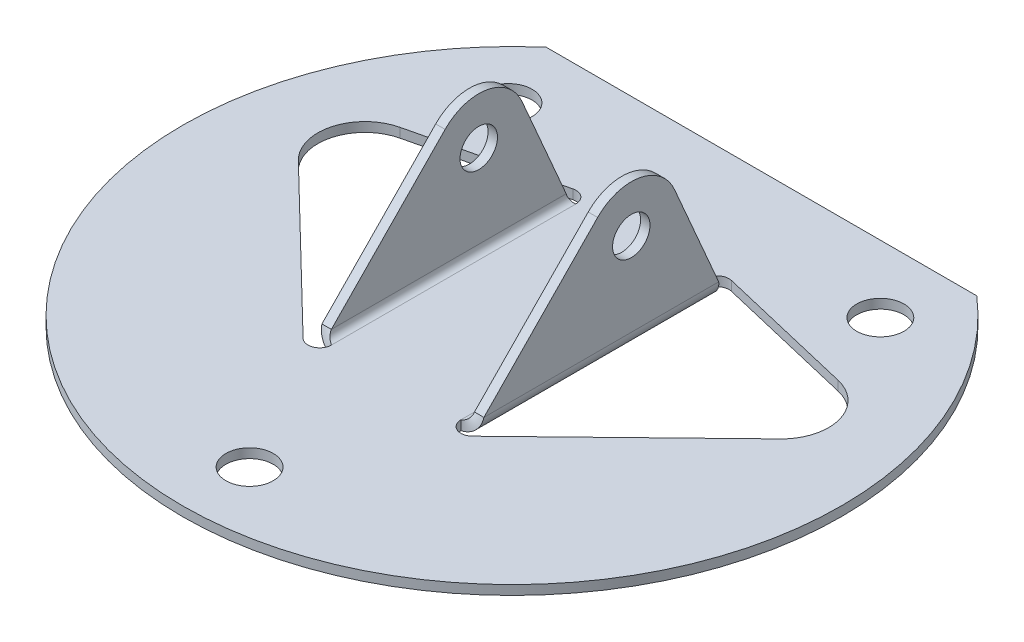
ISO-10303-21;
HEADER;
FILE_DESCRIPTION(('STEP AP214'),'2;1');
FILE_NAME('part.step','',(''),(''),'','','');
FILE_SCHEMA(('AUTOMOTIVE_DESIGN { 1 0 10303 214 1 1 1 1 }'));
ENDSEC;
DATA;
#1=APPLICATION_CONTEXT('core data for automotive mechanical design processes');
#2=APPLICATION_PROTOCOL_DEFINITION('international standard','automotive_design',2000,#1);
#3=PRODUCT_CONTEXT('',#1,'mechanical');
#4=PRODUCT('Part','Part','',(#3));
#5=PRODUCT_RELATED_PRODUCT_CATEGORY('part','',(#4));
#6=PRODUCT_DEFINITION_FORMATION('','',#4);
#7=PRODUCT_DEFINITION_CONTEXT('part definition',#1,'design');
#8=PRODUCT_DEFINITION('design','',#6,#7);
#9=PRODUCT_DEFINITION_SHAPE('','',#8);
#10=(LENGTH_UNIT() NAMED_UNIT(*) SI_UNIT(.MILLI.,.METRE.));
#11=(NAMED_UNIT(*) PLANE_ANGLE_UNIT() SI_UNIT($,.RADIAN.));
#12=(NAMED_UNIT(*) SI_UNIT($,.STERADIAN.) SOLID_ANGLE_UNIT());
#13=UNCERTAINTY_MEASURE_WITH_UNIT(LENGTH_MEASURE(1.E-05),#10,'distance_accuracy_value','');
#14=(GEOMETRIC_REPRESENTATION_CONTEXT(3) GLOBAL_UNCERTAINTY_ASSIGNED_CONTEXT((#13)) GLOBAL_UNIT_ASSIGNED_CONTEXT((#10,
#11,#12)) REPRESENTATION_CONTEXT('',''));
#15=CARTESIAN_POINT('',(0.,0.,0.));
#16=DIRECTION('',(0.,0.,1.));
#17=DIRECTION('',(1.,0.,0.));
#18=AXIS2_PLACEMENT_3D('',#15,#16,#17);
#19=CARTESIAN_POINT('',(0.,-1.016,0.));
#20=DIRECTION('',(0.,1.,0.));
#21=DIRECTION('',(0.,0.,1.));
#22=AXIS2_PLACEMENT_3D('',#19,#20,#21);
#23=CYLINDRICAL_SURFACE('',#22,35.56);
#24=CARTESIAN_POINT('',(0.,0.,0.));
#25=DIRECTION('',(0.,1.,0.));
#26=DIRECTION('',(0.,0.,1.));
#27=AXIS2_PLACEMENT_3D('',#24,#25,#26);
#28=CIRCLE('',#27,35.56);
#29=CARTESIAN_POINT('',(-23.2295463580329,0.,-26.924));
#30=VERTEX_POINT('',#29);
#31=CARTESIAN_POINT('',(23.2295463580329,0.,-26.924));
#32=VERTEX_POINT('',#31);
#33=EDGE_CURVE('E464',#30,#32,#28,.T.);
#34=ORIENTED_EDGE('',*,*,#33,.F.);
#35=DIRECTION('',(0.,1.,0.));
#36=VECTOR('',#35,1.);
#37=CARTESIAN_POINT('',(-23.2295463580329,-1.016,-26.924));
#38=LINE('',#37,#36);
#39=CARTESIAN_POINT('',(-23.2295463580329,-1.016,-26.924));
#40=VERTEX_POINT('',#39);
#41=EDGE_CURVE('E13',#40,#30,#38,.T.);
#42=ORIENTED_EDGE('',*,*,#41,.F.);
#43=CARTESIAN_POINT('',(0.,-1.016,0.));
#44=DIRECTION('',(0.,1.,0.));
#45=DIRECTION('',(0.,0.,1.));
#46=AXIS2_PLACEMENT_3D('',#43,#44,#45);
#47=CIRCLE('',#46,35.56);
#48=CARTESIAN_POINT('',(23.2295463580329,-1.016,-26.924));
#49=VERTEX_POINT('',#48);
#50=EDGE_CURVE('E463',#40,#49,#47,.T.);
#51=ORIENTED_EDGE('',*,*,#50,.T.);
#52=DIRECTION('',(0.,1.,0.));
#53=VECTOR('',#52,1.);
#54=CARTESIAN_POINT('',(23.2295463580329,-1.016,-26.924));
#55=LINE('',#54,#53);
#56=EDGE_CURVE('E80',#49,#32,#55,.T.);
#57=ORIENTED_EDGE('',*,*,#56,.T.);
#58=EDGE_LOOP('',(#34,#42,#51,#57));
#59=FACE_BOUND('',#58,.T.);
#60=ADVANCED_FACE('F77',(#59),#23,.T.);
#61=CARTESIAN_POINT('',(-23.2295463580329,-1.016,-26.924));
#62=DIRECTION('',(0.,0.,-1.));
#63=DIRECTION('',(-1.,0.,0.));
#64=AXIS2_PLACEMENT_3D('',#61,#62,#63);
#65=PLANE('',#64);
#66=DIRECTION('',(-1.,0.,0.));
#67=VECTOR('',#66,1.);
#68=CARTESIAN_POINT('',(-23.2295463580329,0.,-26.924));
#69=LINE('',#68,#67);
#70=EDGE_CURVE('E457',#32,#30,#69,.T.);
#71=ORIENTED_EDGE('',*,*,#70,.F.);
#72=ORIENTED_EDGE('',*,*,#56,.F.);
#73=DIRECTION('',(-1.,0.,0.));
#74=VECTOR('',#73,1.);
#75=CARTESIAN_POINT('',(-23.2295463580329,-1.016,-26.924));
#76=LINE('',#75,#74);
#77=EDGE_CURVE('E466',#49,#40,#76,.T.);
#78=ORIENTED_EDGE('',*,*,#77,.T.);
#79=ORIENTED_EDGE('',*,*,#41,.T.);
#80=EDGE_LOOP('',(#71,#72,#78,#79));
#81=FACE_BOUND('',#80,.T.);
#82=ADVANCED_FACE('F445',(#81),#65,.T.);
#83=CARTESIAN_POINT('',(0.,-1.016,0.));
#84=DIRECTION('',(0.,1.,0.));
#85=DIRECTION('',(0.,0.,1.));
#86=AXIS2_PLACEMENT_3D('',#83,#84,#85);
#87=PLANE('',#86);
#88=CARTESIAN_POINT('',(20.066,-1.016,-19.685));
#89=DIRECTION('',(0.,1.,0.));
#90=DIRECTION('',(0.,0.,1.));
#91=AXIS2_PLACEMENT_3D('',#88,#89,#90);
#92=CIRCLE('',#91,2.55269999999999);
#93=CARTESIAN_POINT('',(20.066,-1.016,-17.1323));
#94=VERTEX_POINT('',#93);
#95=EDGE_CURVE('E970',#94,#94,#92,.T.);
#96=ORIENTED_EDGE('',*,*,#95,.T.);
#97=EDGE_LOOP('',(#96));
#98=FACE_BOUND('',#97,.T.);
#99=CARTESIAN_POINT('',(-20.066,-1.016,-19.685));
#100=DIRECTION('',(0.,1.,0.));
#101=DIRECTION('',(0.,0.,1.));
#102=AXIS2_PLACEMENT_3D('',#99,#100,#101);
#103=CIRCLE('',#102,2.55269999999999);
#104=CARTESIAN_POINT('',(-20.066,-1.016,-17.1323));
#105=VERTEX_POINT('',#104);
#106=EDGE_CURVE('E974',#105,#105,#103,.T.);
#107=ORIENTED_EDGE('',*,*,#106,.T.);
#108=EDGE_LOOP('',(#107));
#109=FACE_BOUND('',#108,.T.);
#110=CARTESIAN_POINT('',(0.,-1.016,28.321));
#111=DIRECTION('',(0.,1.,0.));
#112=DIRECTION('',(0.,0.,1.));
#113=AXIS2_PLACEMENT_3D('',#110,#111,#112);
#114=CIRCLE('',#113,2.55269999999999);
#115=CARTESIAN_POINT('',(0.,-1.016,30.8737));
#116=VERTEX_POINT('',#115);
#117=EDGE_CURVE('E273',#116,#116,#114,.T.);
#118=ORIENTED_EDGE('',*,*,#117,.T.);
#119=EDGE_LOOP('',(#118));
#120=FACE_BOUND('',#119,.T.);
#121=DIRECTION('',(-0.973082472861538,0.,-0.230457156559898));
#122=VECTOR('',#121,1.);
#123=CARTESIAN_POINT('',(8.54768058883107,-1.016,-15.1239070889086));
#124=LINE('',#123,#122);
#125=CARTESIAN_POINT('',(23.6497223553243,-1.016,-11.5472589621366));
#126=VERTEX_POINT('',#125);
#127=CARTESIAN_POINT('',(8.54768058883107,-1.016,-15.1239070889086));
#128=VERTEX_POINT('',#127);
#129=EDGE_CURVE('E521',#126,#128,#124,.T.);
#130=ORIENTED_EDGE('',*,*,#129,.T.);
#131=CARTESIAN_POINT('',(8.255,-1.016,-13.8880923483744));
#132=DIRECTION('',(0.,1.,0.));
#133=DIRECTION('',(0.,0.,-1.));
#134=AXIS2_PLACEMENT_3D('',#131,#132,#133);
#135=CIRCLE('',#134,1.27);
#136=CARTESIAN_POINT('',(6.98499999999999,-1.016,-13.8880923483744));
#137=VERTEX_POINT('',#136);
#138=EDGE_CURVE('E387',#128,#137,#135,.T.);
#139=ORIENTED_EDGE('',*,*,#138,.T.);
#140=DIRECTION('',(0.,0.,1.));
#141=VECTOR('',#140,1.);
#142=CARTESIAN_POINT('',(6.985,-1.016,12.4937400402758));
#143=LINE('',#142,#141);
#144=CARTESIAN_POINT('',(6.985,-1.016,12.4937400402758));
#145=VERTEX_POINT('',#144);
#146=EDGE_CURVE('E558',#137,#145,#143,.T.);
#147=ORIENTED_EDGE('',*,*,#146,.T.);
#148=CARTESIAN_POINT('',(8.255,-1.016,12.4937400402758));
#149=DIRECTION('',(0.,1.,0.));
#150=DIRECTION('',(0.,0.,-1.));
#151=AXIS2_PLACEMENT_3D('',#148,#149,#150);
#152=CIRCLE('',#151,1.27);
#153=CARTESIAN_POINT('',(9.13903914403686,-1.016,13.4055376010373));
#154=VERTEX_POINT('',#153);
#155=EDGE_CURVE('E556',#145,#154,#152,.T.);
#156=ORIENTED_EDGE('',*,*,#155,.T.);
#157=DIRECTION('',(0.717950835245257,0.,-0.696093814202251));
#158=VECTOR('',#157,1.);
#159=CARTESIAN_POINT('',(26.0151565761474,-1.016,-2.9568097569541));
#160=LINE('',#159,#158);
#161=CARTESIAN_POINT('',(26.0151565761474,-1.016,-2.9568097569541));
#162=VERTEX_POINT('',#161);
#163=EDGE_CURVE('E553',#154,#162,#160,.T.);
#164=ORIENTED_EDGE('',*,*,#163,.T.);
#165=CARTESIAN_POINT('',(22.479,-1.016,-6.60400000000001));
#166=DIRECTION('',(0.,1.,0.));
#167=DIRECTION('',(0.,0.,-1.));
#168=AXIS2_PLACEMENT_3D('',#165,#166,#167);
#169=CIRCLE('',#168,5.08);
#170=EDGE_CURVE('E550',#162,#126,#169,.T.);
#171=ORIENTED_EDGE('',*,*,#170,.T.);
#172=EDGE_LOOP('',(#130,#139,#147,#156,#164,#171));
#173=FACE_BOUND('',#172,.T.);
#174=DIRECTION('',(-0.973082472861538,0.,0.230457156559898));
#175=VECTOR('',#174,1.);
#176=CARTESIAN_POINT('',(-8.54768058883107,-1.016,-15.1239070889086));
#177=LINE('',#176,#175);
#178=CARTESIAN_POINT('',(-8.54768058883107,-1.016,-15.1239070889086));
#179=VERTEX_POINT('',#178);
#180=CARTESIAN_POINT('',(-23.6497223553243,-1.016,-11.5472589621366));
#181=VERTEX_POINT('',#180);
#182=EDGE_CURVE('E476',#179,#181,#177,.T.);
#183=ORIENTED_EDGE('',*,*,#182,.T.);
#184=CARTESIAN_POINT('',(-22.479,-1.016,-6.604));
#185=DIRECTION('',(0.,1.,0.));
#186=DIRECTION('',(0.,0.,1.));
#187=AXIS2_PLACEMENT_3D('',#184,#185,#186);
#188=CIRCLE('',#187,5.08);
#189=CARTESIAN_POINT('',(-26.0151565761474,-1.016,-2.95680975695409));
#190=VERTEX_POINT('',#189);
#191=EDGE_CURVE('E489',#181,#190,#188,.T.);
#192=ORIENTED_EDGE('',*,*,#191,.T.);
#193=DIRECTION('',(0.717950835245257,0.,0.69609381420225));
#194=VECTOR('',#193,1.);
#195=CARTESIAN_POINT('',(-26.0151565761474,-1.016,-2.95680975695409));
#196=LINE('',#195,#194);
#197=CARTESIAN_POINT('',(-9.13903914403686,-1.016,13.4055376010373));
#198=VERTEX_POINT('',#197);
#199=EDGE_CURVE('E513',#190,#198,#196,.T.);
#200=ORIENTED_EDGE('',*,*,#199,.T.);
#201=CARTESIAN_POINT('',(-8.255,-1.016,12.4937400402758));
#202=DIRECTION('',(0.,1.,0.));
#203=DIRECTION('',(0.,0.,1.));
#204=AXIS2_PLACEMENT_3D('',#201,#202,#203);
#205=CIRCLE('',#204,1.27);
#206=CARTESIAN_POINT('',(-6.985,-1.016,12.4937400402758));
#207=VERTEX_POINT('',#206);
#208=EDGE_CURVE('E99',#198,#207,#205,.T.);
#209=ORIENTED_EDGE('',*,*,#208,.T.);
#210=DIRECTION('',(0.,0.,-1.));
#211=VECTOR('',#210,1.);
#212=CARTESIAN_POINT('',(-6.985,-1.016,12.4937400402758));
#213=LINE('',#212,#211);
#214=CARTESIAN_POINT('',(-6.985,-1.016,-13.8880923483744));
#215=VERTEX_POINT('',#214);
#216=EDGE_CURVE('E509',#207,#215,#213,.T.);
#217=ORIENTED_EDGE('',*,*,#216,.T.);
#218=CARTESIAN_POINT('',(-8.255,-1.016,-13.8880923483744));
#219=DIRECTION('',(0.,1.,0.));
#220=DIRECTION('',(0.,0.,1.));
#221=AXIS2_PLACEMENT_3D('',#218,#219,#220);
#222=CIRCLE('',#221,1.27);
#223=EDGE_CURVE('E506',#215,#179,#222,.T.);
#224=ORIENTED_EDGE('',*,*,#223,.T.);
#225=EDGE_LOOP('',(#183,#192,#200,#209,#217,#224));
#226=FACE_BOUND('',#225,.T.);
#227=ORIENTED_EDGE('',*,*,#50,.F.);
#228=ORIENTED_EDGE('',*,*,#77,.F.);
#229=EDGE_LOOP('',(#227,#228));
#230=FACE_BOUND('',#229,.T.);
#231=ADVANCED_FACE('F442',(#98,#109,#120,#173,#226,#230),#87,.F.);
#232=CARTESIAN_POINT('',(0.,0.,0.));
#233=DIRECTION('',(0.,1.,0.));
#234=DIRECTION('',(0.,0.,1.));
#235=AXIS2_PLACEMENT_3D('',#232,#233,#234);
#236=PLANE('',#235);
#237=CARTESIAN_POINT('',(20.066,0.,-19.685));
#238=DIRECTION('',(0.,1.,0.));
#239=DIRECTION('',(0.,0.,1.));
#240=AXIS2_PLACEMENT_3D('',#237,#238,#239);
#241=CIRCLE('',#240,2.55269999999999);
#242=CARTESIAN_POINT('',(20.066,0.,-17.1323));
#243=VERTEX_POINT('',#242);
#244=EDGE_CURVE('E967',#243,#243,#241,.T.);
#245=ORIENTED_EDGE('',*,*,#244,.F.);
#246=EDGE_LOOP('',(#245));
#247=FACE_BOUND('',#246,.T.);
#248=CARTESIAN_POINT('',(-20.066,0.,-19.685));
#249=DIRECTION('',(0.,1.,0.));
#250=DIRECTION('',(0.,0.,1.));
#251=AXIS2_PLACEMENT_3D('',#248,#249,#250);
#252=CIRCLE('',#251,2.55269999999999);
#253=CARTESIAN_POINT('',(-20.066,0.,-17.1323));
#254=VERTEX_POINT('',#253);
#255=EDGE_CURVE('E971',#254,#254,#252,.T.);
#256=ORIENTED_EDGE('',*,*,#255,.F.);
#257=EDGE_LOOP('',(#256));
#258=FACE_BOUND('',#257,.T.);
#259=CARTESIAN_POINT('',(0.,0.,28.321));
#260=DIRECTION('',(0.,1.,0.));
#261=DIRECTION('',(0.,0.,1.));
#262=AXIS2_PLACEMENT_3D('',#259,#260,#261);
#263=CIRCLE('',#262,2.55269999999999);
#264=CARTESIAN_POINT('',(0.,0.,30.8737));
#265=VERTEX_POINT('',#264);
#266=EDGE_CURVE('E980',#265,#265,#263,.T.);
#267=ORIENTED_EDGE('',*,*,#266,.F.);
#268=EDGE_LOOP('',(#267));
#269=FACE_BOUND('',#268,.T.);
#270=CARTESIAN_POINT('',(8.255,0.,-13.8880923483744));
#271=DIRECTION('',(0.,1.,0.));
#272=DIRECTION('',(0.,0.,-1.));
#273=AXIS2_PLACEMENT_3D('',#270,#271,#272);
#274=CIRCLE('',#273,1.27);
#275=CARTESIAN_POINT('',(8.54768058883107,0.,-15.1239070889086));
#276=VERTEX_POINT('',#275);
#277=CARTESIAN_POINT('',(6.98499999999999,0.,-13.8880923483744));
#278=VERTEX_POINT('',#277);
#279=EDGE_CURVE('E545',#276,#278,#274,.T.);
#280=ORIENTED_EDGE('',*,*,#279,.F.);
#281=DIRECTION('',(-0.973082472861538,0.,-0.230457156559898));
#282=VECTOR('',#281,1.);
#283=CARTESIAN_POINT('',(8.54768058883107,0.,-15.1239070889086));
#284=LINE('',#283,#282);
#285=CARTESIAN_POINT('',(23.6497223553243,0.,-11.5472589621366));
#286=VERTEX_POINT('',#285);
#287=EDGE_CURVE('E531',#286,#276,#284,.T.);
#288=ORIENTED_EDGE('',*,*,#287,.F.);
#289=CARTESIAN_POINT('',(22.479,0.,-6.60400000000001));
#290=DIRECTION('',(0.,1.,0.));
#291=DIRECTION('',(0.,0.,-1.));
#292=AXIS2_PLACEMENT_3D('',#289,#290,#291);
#293=CIRCLE('',#292,5.08);
#294=CARTESIAN_POINT('',(26.0151565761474,0.,-2.9568097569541));
#295=VERTEX_POINT('',#294);
#296=EDGE_CURVE('E534',#295,#286,#293,.T.);
#297=ORIENTED_EDGE('',*,*,#296,.F.);
#298=DIRECTION('',(0.717950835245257,0.,-0.696093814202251));
#299=VECTOR('',#298,1.);
#300=CARTESIAN_POINT('',(26.0151565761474,0.,-2.9568097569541));
#301=LINE('',#300,#299);
#302=CARTESIAN_POINT('',(9.13903914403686,0.,13.4055376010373));
#303=VERTEX_POINT('',#302);
#304=EDGE_CURVE('E537',#303,#295,#301,.T.);
#305=ORIENTED_EDGE('',*,*,#304,.F.);
#306=CARTESIAN_POINT('',(8.255,0.,12.4937400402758));
#307=DIRECTION('',(0.,1.,0.));
#308=DIRECTION('',(0.,0.,-1.));
#309=AXIS2_PLACEMENT_3D('',#306,#307,#308);
#310=CIRCLE('',#309,1.27);
#311=CARTESIAN_POINT('',(6.98499999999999,0.,12.4937400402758));
#312=VERTEX_POINT('',#311);
#313=EDGE_CURVE('E540',#312,#303,#310,.T.);
#314=ORIENTED_EDGE('',*,*,#313,.F.);
#315=DIRECTION('',(0.,0.,1.));
#316=VECTOR('',#315,1.);
#317=CARTESIAN_POINT('',(6.985,0.,12.4937400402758));
#318=LINE('',#317,#316);
#319=EDGE_CURVE('E543',#278,#312,#318,.T.);
#320=ORIENTED_EDGE('',*,*,#319,.F.);
#321=EDGE_LOOP('',(#280,#288,#297,#305,#314,#320));
#322=FACE_BOUND('',#321,.T.);
#323=CARTESIAN_POINT('',(-22.479,0.,-6.604));
#324=DIRECTION('',(0.,1.,0.));
#325=DIRECTION('',(0.,0.,1.));
#326=AXIS2_PLACEMENT_3D('',#323,#324,#325);
#327=CIRCLE('',#326,5.08);
#328=CARTESIAN_POINT('',(-23.6497223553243,0.,-11.5472589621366));
#329=VERTEX_POINT('',#328);
#330=CARTESIAN_POINT('',(-26.0151565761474,0.,-2.95680975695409));
#331=VERTEX_POINT('',#330);
#332=EDGE_CURVE('E501',#329,#331,#327,.T.);
#333=ORIENTED_EDGE('',*,*,#332,.F.);
#334=DIRECTION('',(-0.973082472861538,0.,0.230457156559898));
#335=VECTOR('',#334,1.);
#336=CARTESIAN_POINT('',(-8.54768058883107,0.,-15.1239070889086));
#337=LINE('',#336,#335);
#338=CARTESIAN_POINT('',(-8.54768058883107,0.,-15.1239070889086));
#339=VERTEX_POINT('',#338);
#340=EDGE_CURVE('E486',#339,#329,#337,.T.);
#341=ORIENTED_EDGE('',*,*,#340,.F.);
#342=CARTESIAN_POINT('',(-8.255,0.,-13.8880923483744));
#343=DIRECTION('',(0.,1.,0.));
#344=DIRECTION('',(0.,0.,1.));
#345=AXIS2_PLACEMENT_3D('',#342,#343,#344);
#346=CIRCLE('',#345,1.27);
#347=CARTESIAN_POINT('',(-6.985,0.,-13.8880923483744));
#348=VERTEX_POINT('',#347);
#349=EDGE_CURVE('E490',#348,#339,#346,.T.);
#350=ORIENTED_EDGE('',*,*,#349,.F.);
#351=DIRECTION('',(0.,0.,-1.));
#352=VECTOR('',#351,1.);
#353=CARTESIAN_POINT('',(-6.985,0.,12.4937400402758));
#354=LINE('',#353,#352);
#355=CARTESIAN_POINT('',(-6.985,0.,12.4937400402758));
#356=VERTEX_POINT('',#355);
#357=EDGE_CURVE('E493',#356,#348,#354,.T.);
#358=ORIENTED_EDGE('',*,*,#357,.F.);
#359=CARTESIAN_POINT('',(-8.255,0.,12.4937400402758));
#360=DIRECTION('',(0.,1.,0.));
#361=DIRECTION('',(0.,0.,1.));
#362=AXIS2_PLACEMENT_3D('',#359,#360,#361);
#363=CIRCLE('',#362,1.27);
#364=CARTESIAN_POINT('',(-9.13903914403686,0.,13.4055376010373));
#365=VERTEX_POINT('',#364);
#366=EDGE_CURVE('E495',#365,#356,#363,.T.);
#367=ORIENTED_EDGE('',*,*,#366,.F.);
#368=DIRECTION('',(0.717950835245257,0.,0.69609381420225));
#369=VECTOR('',#368,1.);
#370=CARTESIAN_POINT('',(-26.0151565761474,0.,-2.95680975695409));
#371=LINE('',#370,#369);
#372=EDGE_CURVE('E498',#331,#365,#371,.T.);
#373=ORIENTED_EDGE('',*,*,#372,.F.);
#374=EDGE_LOOP('',(#333,#341,#350,#358,#367,#373));
#375=FACE_BOUND('',#374,.T.);
#376=ORIENTED_EDGE('',*,*,#33,.T.);
#377=ORIENTED_EDGE('',*,*,#70,.T.);
#378=EDGE_LOOP('',(#376,#377));
#379=FACE_BOUND('',#378,.T.);
#380=ADVANCED_FACE('F440',(#247,#258,#269,#322,#375,#379),#236,.T.);
#381=CARTESIAN_POINT('',(-22.479,-1.016,-6.604));
#382=DIRECTION('',(0.,1.,0.));
#383=DIRECTION('',(0.,0.,1.));
#384=AXIS2_PLACEMENT_3D('',#381,#382,#383);
#385=CYLINDRICAL_SURFACE('',#384,5.08);
#386=ORIENTED_EDGE('',*,*,#332,.T.);
#387=DIRECTION('',(0.,1.,0.));
#388=VECTOR('',#387,1.);
#389=CARTESIAN_POINT('',(-26.0151565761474,-1.016,-2.95680975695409));
#390=LINE('',#389,#388);
#391=EDGE_CURVE('E472',#190,#331,#390,.T.);
#392=ORIENTED_EDGE('',*,*,#391,.F.);
#393=ORIENTED_EDGE('',*,*,#191,.F.);
#394=DIRECTION('',(0.,1.,0.));
#395=VECTOR('',#394,1.);
#396=CARTESIAN_POINT('',(-23.6497223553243,-1.016,-11.5472589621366));
#397=LINE('',#396,#395);
#398=EDGE_CURVE('E468',#181,#329,#397,.T.);
#399=ORIENTED_EDGE('',*,*,#398,.T.);
#400=EDGE_LOOP('',(#386,#392,#393,#399));
#401=FACE_BOUND('',#400,.T.);
#402=ADVANCED_FACE('F427',(#401),#385,.F.);
#403=CARTESIAN_POINT('',(-8.54768058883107,-1.016,-15.1239070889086));
#404=DIRECTION('',(-0.230457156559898,0.,-0.973082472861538));
#405=DIRECTION('',(-0.973082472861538,0.,0.230457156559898));
#406=AXIS2_PLACEMENT_3D('',#403,#404,#405);
#407=PLANE('',#406);
#408=ORIENTED_EDGE('',*,*,#340,.T.);
#409=ORIENTED_EDGE('',*,*,#398,.F.);
#410=ORIENTED_EDGE('',*,*,#182,.F.);
#411=DIRECTION('',(0.,1.,0.));
#412=VECTOR('',#411,1.);
#413=CARTESIAN_POINT('',(-8.54768058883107,-1.016,-15.1239070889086));
#414=LINE('',#413,#412);
#415=EDGE_CURVE('E483',#179,#339,#414,.T.);
#416=ORIENTED_EDGE('',*,*,#415,.T.);
#417=EDGE_LOOP('',(#408,#409,#410,#416));
#418=FACE_BOUND('',#417,.T.);
#419=ADVANCED_FACE('F423',(#418),#407,.F.);
#420=CARTESIAN_POINT('',(-8.255,-1.016,-13.8880923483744));
#421=DIRECTION('',(0.,1.,0.));
#422=DIRECTION('',(0.,0.,1.));
#423=AXIS2_PLACEMENT_3D('',#420,#421,#422);
#424=CYLINDRICAL_SURFACE('',#423,1.27);
#425=ORIENTED_EDGE('',*,*,#349,.T.);
#426=ORIENTED_EDGE('',*,*,#415,.F.);
#427=ORIENTED_EDGE('',*,*,#223,.F.);
#428=DIRECTION('',(0.,1.,0.));
#429=VECTOR('',#428,1.);
#430=CARTESIAN_POINT('',(-6.985,-1.016,-13.8880923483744));
#431=LINE('',#430,#429);
#432=EDGE_CURVE('E480',#215,#348,#431,.T.);
#433=ORIENTED_EDGE('',*,*,#432,.T.);
#434=EDGE_LOOP('',(#425,#426,#427,#433));
#435=FACE_BOUND('',#434,.T.);
#436=ADVANCED_FACE('F426',(#435),#424,.F.);
#437=CARTESIAN_POINT('',(-8.255,-1.016,12.4937400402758));
#438=DIRECTION('',(0.,1.,0.));
#439=DIRECTION('',(0.,0.,1.));
#440=AXIS2_PLACEMENT_3D('',#437,#438,#439);
#441=CYLINDRICAL_SURFACE('',#440,1.27);
#442=ORIENTED_EDGE('',*,*,#366,.T.);
#443=DIRECTION('',(0.,1.,0.));
#444=VECTOR('',#443,1.);
#445=CARTESIAN_POINT('',(-6.985,-1.016,12.4937400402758));
#446=LINE('',#445,#444);
#447=EDGE_CURVE('E478',#207,#356,#446,.T.);
#448=ORIENTED_EDGE('',*,*,#447,.F.);
#449=ORIENTED_EDGE('',*,*,#208,.F.);
#450=DIRECTION('',(0.,1.,0.));
#451=VECTOR('',#450,1.);
#452=CARTESIAN_POINT('',(-9.13903914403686,-1.016,13.4055376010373));
#453=LINE('',#452,#451);
#454=EDGE_CURVE('E475',#198,#365,#453,.T.);
#455=ORIENTED_EDGE('',*,*,#454,.T.);
#456=EDGE_LOOP('',(#442,#448,#449,#455));
#457=FACE_BOUND('',#456,.T.);
#458=ADVANCED_FACE('F431',(#457),#441,.F.);
#459=CARTESIAN_POINT('',(-26.0151565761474,-1.016,-2.95680975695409));
#460=DIRECTION('',(-0.696093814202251,0.,0.717950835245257));
#461=DIRECTION('',(0.717950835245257,0.,0.696093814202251));
#462=AXIS2_PLACEMENT_3D('',#459,#460,#461);
#463=PLANE('',#462);
#464=ORIENTED_EDGE('',*,*,#372,.T.);
#465=ORIENTED_EDGE('',*,*,#454,.F.);
#466=ORIENTED_EDGE('',*,*,#199,.F.);
#467=ORIENTED_EDGE('',*,*,#391,.T.);
#468=EDGE_LOOP('',(#464,#465,#466,#467));
#469=FACE_BOUND('',#468,.T.);
#470=ADVANCED_FACE('F421',(#469),#463,.F.);
#471=CARTESIAN_POINT('',(8.255,-1.016,-13.8880923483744));
#472=DIRECTION('',(0.,1.,0.));
#473=DIRECTION('',(0.,0.,1.));
#474=AXIS2_PLACEMENT_3D('',#471,#472,#473);
#475=CYLINDRICAL_SURFACE('',#474,1.27);
#476=ORIENTED_EDGE('',*,*,#279,.T.);
#477=DIRECTION('',(0.,1.,0.));
#478=VECTOR('',#477,1.);
#479=CARTESIAN_POINT('',(6.98499999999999,-1.016,-13.8880923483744));
#480=LINE('',#479,#478);
#481=EDGE_CURVE('E518',#137,#278,#480,.T.);
#482=ORIENTED_EDGE('',*,*,#481,.F.);
#483=ORIENTED_EDGE('',*,*,#138,.F.);
#484=DIRECTION('',(0.,1.,0.));
#485=VECTOR('',#484,1.);
#486=CARTESIAN_POINT('',(8.54768058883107,-1.016,-15.1239070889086));
#487=LINE('',#486,#485);
#488=EDGE_CURVE('E503',#128,#276,#487,.T.);
#489=ORIENTED_EDGE('',*,*,#488,.T.);
#490=EDGE_LOOP('',(#476,#482,#483,#489));
#491=FACE_BOUND('',#490,.T.);
#492=ADVANCED_FACE('F406',(#491),#475,.F.);
#493=CARTESIAN_POINT('',(8.54768058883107,-1.016,-15.1239070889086));
#494=DIRECTION('',(0.230457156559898,0.,-0.973082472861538));
#495=DIRECTION('',(-0.973082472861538,0.,-0.230457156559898));
#496=AXIS2_PLACEMENT_3D('',#493,#494,#495);
#497=PLANE('',#496);
#498=ORIENTED_EDGE('',*,*,#287,.T.);
#499=ORIENTED_EDGE('',*,*,#488,.F.);
#500=ORIENTED_EDGE('',*,*,#129,.F.);
#501=DIRECTION('',(0.,1.,0.));
#502=VECTOR('',#501,1.);
#503=CARTESIAN_POINT('',(23.6497223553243,-1.016,-11.5472589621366));
#504=LINE('',#503,#502);
#505=EDGE_CURVE('E528',#126,#286,#504,.T.);
#506=ORIENTED_EDGE('',*,*,#505,.T.);
#507=EDGE_LOOP('',(#498,#499,#500,#506));
#508=FACE_BOUND('',#507,.T.);
#509=ADVANCED_FACE('F396',(#508),#497,.F.);
#510=CARTESIAN_POINT('',(22.479,-1.016,-6.60400000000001));
#511=DIRECTION('',(0.,1.,0.));
#512=DIRECTION('',(0.,0.,1.));
#513=AXIS2_PLACEMENT_3D('',#510,#511,#512);
#514=CYLINDRICAL_SURFACE('',#513,5.08);
#515=ORIENTED_EDGE('',*,*,#296,.T.);
#516=ORIENTED_EDGE('',*,*,#505,.F.);
#517=ORIENTED_EDGE('',*,*,#170,.F.);
#518=DIRECTION('',(0.,1.,0.));
#519=VECTOR('',#518,1.);
#520=CARTESIAN_POINT('',(26.0151565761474,-1.016,-2.9568097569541));
#521=LINE('',#520,#519);
#522=EDGE_CURVE('E526',#162,#295,#521,.T.);
#523=ORIENTED_EDGE('',*,*,#522,.T.);
#524=EDGE_LOOP('',(#515,#516,#517,#523));
#525=FACE_BOUND('',#524,.T.);
#526=ADVANCED_FACE('F405',(#525),#514,.F.);
#527=CARTESIAN_POINT('',(26.0151565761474,-1.016,-2.9568097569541));
#528=DIRECTION('',(0.696093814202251,0.,0.717950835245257));
#529=DIRECTION('',(0.717950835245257,0.,-0.696093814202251));
#530=AXIS2_PLACEMENT_3D('',#527,#528,#529);
#531=PLANE('',#530);
#532=ORIENTED_EDGE('',*,*,#304,.T.);
#533=ORIENTED_EDGE('',*,*,#522,.F.);
#534=ORIENTED_EDGE('',*,*,#163,.F.);
#535=DIRECTION('',(0.,1.,0.));
#536=VECTOR('',#535,1.);
#537=CARTESIAN_POINT('',(9.13903914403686,-1.016,13.4055376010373));
#538=LINE('',#537,#536);
#539=EDGE_CURVE('E524',#154,#303,#538,.T.);
#540=ORIENTED_EDGE('',*,*,#539,.T.);
#541=EDGE_LOOP('',(#532,#533,#534,#540));
#542=FACE_BOUND('',#541,.T.);
#543=ADVANCED_FACE('F410',(#542),#531,.F.);
#544=CARTESIAN_POINT('',(8.255,-1.016,12.4937400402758));
#545=DIRECTION('',(0.,1.,0.));
#546=DIRECTION('',(0.,0.,1.));
#547=AXIS2_PLACEMENT_3D('',#544,#545,#546);
#548=CYLINDRICAL_SURFACE('',#547,1.27);
#549=ORIENTED_EDGE('',*,*,#313,.T.);
#550=ORIENTED_EDGE('',*,*,#539,.F.);
#551=ORIENTED_EDGE('',*,*,#155,.F.);
#552=DIRECTION('',(0.,1.,0.));
#553=VECTOR('',#552,1.);
#554=CARTESIAN_POINT('',(6.985,-1.016,12.4937400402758));
#555=LINE('',#554,#553);
#556=EDGE_CURVE('E520',#145,#312,#555,.T.);
#557=ORIENTED_EDGE('',*,*,#556,.T.);
#558=EDGE_LOOP('',(#549,#550,#551,#557));
#559=FACE_BOUND('',#558,.T.);
#560=ADVANCED_FACE('F414',(#559),#548,.F.);
#561=CARTESIAN_POINT('',(-6.985,-1.02616,-13.8880923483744));
#562=CARTESIAN_POINT('',(-7.21578580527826,-1.02616,-13.8614900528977));
#563=CARTESIAN_POINT('',(-7.44639870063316,-0.980280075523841,-13.8348972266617));
#564=CARTESIAN_POINT('',(-7.8727593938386,-0.803675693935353,-13.781702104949));
#565=CARTESIAN_POINT('',(-8.06829837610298,-0.673020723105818,-13.7551045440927));
#566=CARTESIAN_POINT('',(-8.39462072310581,-0.346698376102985,-13.70190942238));
#567=CARTESIAN_POINT('',(-8.52527569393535,-0.151159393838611,-13.6753118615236));
#568=CARTESIAN_POINT('',(-8.70188007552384,0.27520129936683,-13.6221167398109));
#569=CARTESIAN_POINT('',(-8.74776,0.505814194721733,-13.5955239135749));
#570=CARTESIAN_POINT('',(-8.74776,0.736599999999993,-13.5689216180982));
#571=CARTESIAN_POINT('',(-6.985,-1.016,-13.8880923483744));
#572=CARTESIAN_POINT('',(-7.21445561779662,-1.016,-13.8614900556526));
#573=CARTESIAN_POINT('',(-7.44373934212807,-0.970384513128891,-13.8348972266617));
#574=CARTESIAN_POINT('',(-7.86764262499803,-0.794798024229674,-13.781702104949));
#575=CARTESIAN_POINT('',(-8.06205458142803,-0.664896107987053,-13.7551045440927));
#576=CARTESIAN_POINT('',(-8.38649610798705,-0.340454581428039,-13.70190942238));
#577=CARTESIAN_POINT('',(-8.51639802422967,-0.146042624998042,-13.6753118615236));
#578=CARTESIAN_POINT('',(-8.69198451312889,0.27786065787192,-13.6221167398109));
#579=CARTESIAN_POINT('',(-8.7376,0.507144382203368,-13.59552391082));
#580=CARTESIAN_POINT('',(-8.7376,0.736599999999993,-13.5689216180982));
#581=CARTESIAN_POINT('',(-6.985,0.,-13.8880923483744));
#582=CARTESIAN_POINT('',(-7.08143686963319,0.,-13.8614903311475));
#583=CARTESIAN_POINT('',(-7.17780349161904,0.0191717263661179,-13.8348972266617));
#584=CARTESIAN_POINT('',(-7.3559657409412,0.0929689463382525,-13.781702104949));
#585=CARTESIAN_POINT('',(-7.43767511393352,0.147565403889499,-13.7551045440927));
#586=CARTESIAN_POINT('',(-7.5740345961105,0.283924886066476,-13.70190942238));
#587=CARTESIAN_POINT('',(-7.62863105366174,0.365634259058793,-13.6753118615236));
#588=CARTESIAN_POINT('',(-7.70242827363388,0.543796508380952,-13.6221167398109));
#589=CARTESIAN_POINT('',(-7.7216,0.640163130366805,-13.5955236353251));
#590=CARTESIAN_POINT('',(-7.7216,0.736599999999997,-13.5689216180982));
#591=CARTESIAN_POINT('',(-6.985,0.0102615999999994,-13.8880923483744));
#592=CARTESIAN_POINT('',(-7.08009338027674,0.0102615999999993,-13.86149033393));
#593=CARTESIAN_POINT('',(-7.1751175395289,0.0291662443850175,-13.8348972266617));
#594=CARTESIAN_POINT('',(-7.35079780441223,0.101935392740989,-13.781702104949));
#595=CARTESIAN_POINT('',(-7.43136888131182,0.155771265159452,-13.7551045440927));
#596=CARTESIAN_POINT('',(-7.56582873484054,0.290231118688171,-13.70190942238));
#597=CARTESIAN_POINT('',(-7.61966460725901,0.370802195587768,-13.6753118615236));
#598=CARTESIAN_POINT('',(-7.69243375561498,0.546482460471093,-13.6221167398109));
#599=CARTESIAN_POINT('',(-7.7113384,0.641506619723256,-13.5955236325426));
#600=CARTESIAN_POINT('',(-7.7113384,0.736599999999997,-13.5689216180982));
#601=B_SPLINE_SURFACE_WITH_KNOTS('',1,3,((#561,#562,#563,#564,#565,#566,#567,#568,#569,#570),
(#571,#572,#573,#574,#575,#576,#577,#578,#579,#580),(#581,#582,#583,#584,#585,#586,#587,#588,
#589,#590),(#591,#592,#593,#594,#595,#596,#597,#598,#599,#600)),.UNSPECIFIED.,.F.,.F.,.F.,(2,1,
1,2),(4,2,2,2,4),(-0.01,0.,1.,1.0101),(0.,0.25,0.5,0.75,1.),.UNSPECIFIED.);
#602=DIRECTION('',(1.,0.,0.));
#603=VECTOR('',#602,1.);
#604=CARTESIAN_POINT('',(-8.7376,0.736599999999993,-13.5689216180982));
#605=LINE('',#604,#603);
#606=CARTESIAN_POINT('',(-7.7216,0.736599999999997,-13.5689216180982));
#607=VERTEX_POINT('',#606);
#608=CARTESIAN_POINT('',(-8.7376,0.736599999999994,-13.5689216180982));
#609=VERTEX_POINT('',#608);
#610=EDGE_CURVE('E346',#607,#609,#605,.F.);
#611=CARTESIAN_POINT('',(-6.985,0.,-13.8880923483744));
#612=CARTESIAN_POINT('',(-6.99705260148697,-2.5566559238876E-07,-13.8847676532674));
#613=CARTESIAN_POINT('',(-7.00910518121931,0.000295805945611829,-13.8814429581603));
#614=CARTESIAN_POINT('',(-7.03318131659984,0.00147872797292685,-13.8747935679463));
#615=CARTESIAN_POINT('',(-7.04520487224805,0.00236558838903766,-13.8714688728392));
#616=CARTESIAN_POINT('',(-7.06919397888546,0.00472827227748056,-13.8648194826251));
#617=CARTESIAN_POINT('',(-7.08115952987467,0.00620409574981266,-13.8614947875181));
#618=CARTESIAN_POINT('',(-7.10500380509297,0.00974106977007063,-13.854845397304));
#619=CARTESIAN_POINT('',(-7.11688252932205,0.0118022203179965,-13.8515207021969));
#620=CARTESIAN_POINT('',(-7.1405245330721,0.0165049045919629,-13.8448713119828));
#621=CARTESIAN_POINT('',(-7.15228781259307,0.0191464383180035,-13.8415466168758));
#622=CARTESIAN_POINT('',(-7.17567058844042,0.0250035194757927,-13.8348972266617));
#623=CARTESIAN_POINT('',(-7.18729008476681,0.0282190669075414,-13.8315725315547));
#624=CARTESIAN_POINT('',(-7.21035730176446,0.0352164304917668,-13.8249231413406));
#625=CARTESIAN_POINT('',(-7.22180502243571,0.0389982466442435,-13.8215984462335));
#626=CARTESIAN_POINT('',(-7.2445011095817,0.0471190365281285,-13.8149490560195));
#627=CARTESIAN_POINT('',(-7.25574947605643,0.0514580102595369,-13.8116243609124));
#628=CARTESIAN_POINT('',(-7.27801975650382,0.0606826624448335,-13.8049749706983));
#629=CARTESIAN_POINT('',(-7.28904167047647,0.0655683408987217,-13.8016502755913));
#630=CARTESIAN_POINT('',(-7.31083249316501,0.07587463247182,-13.7950008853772));
#631=CARTESIAN_POINT('',(-7.3216014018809,0.0812952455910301,-13.7916761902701));
#632=CARTESIAN_POINT('',(-7.34286027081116,0.0926583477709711,-13.7850268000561));
#633=CARTESIAN_POINT('',(-7.35335023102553,0.0986008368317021,-13.781702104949));
#634=CARTESIAN_POINT('',(-7.37402593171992,0.110993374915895,-13.7750527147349));
#635=CARTESIAN_POINT('',(-7.38421167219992,0.117443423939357,-13.7717280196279));
#636=CARTESIAN_POINT('',(-7.40425439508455,0.130835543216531,-13.7650786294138));
#637=CARTESIAN_POINT('',(-7.41411137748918,0.137777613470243,-13.7617539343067));
#638=CARTESIAN_POINT('',(-7.43347283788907,0.152137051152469,-13.7551045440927));
#639=CARTESIAN_POINT('',(-7.44297731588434,0.159554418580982,-13.7517798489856));
#640=CARTESIAN_POINT('',(-7.46161087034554,0.174846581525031,-13.7451304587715));
#641=CARTESIAN_POINT('',(-7.47073994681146,0.182721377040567,-13.7418057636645));
#642=CARTESIAN_POINT('',(-7.48860070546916,0.198909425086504,-13.7351563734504));
#643=CARTESIAN_POINT('',(-7.49733238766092,0.207222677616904,-13.7318316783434));
#644=CARTESIAN_POINT('',(-7.51437732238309,0.224267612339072,-13.7251822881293));
#645=CARTESIAN_POINT('',(-7.52269057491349,0.232999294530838,-13.7218575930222));
#646=CARTESIAN_POINT('',(-7.53887862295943,0.250860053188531,-13.7152082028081));
#647=CARTESIAN_POINT('',(-7.54675341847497,0.259989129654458,-13.7118835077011));
#648=CARTESIAN_POINT('',(-7.56204558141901,0.278622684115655,-13.705234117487));
#649=CARTESIAN_POINT('',(-7.56946294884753,0.288127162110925,-13.70190942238));
#650=CARTESIAN_POINT('',(-7.58382238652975,0.307488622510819,-13.6952600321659));
#651=CARTESIAN_POINT('',(-7.59076445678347,0.317345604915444,-13.6919353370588));
#652=CARTESIAN_POINT('',(-7.60415657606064,0.337388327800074,-13.6852859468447));
#653=CARTESIAN_POINT('',(-7.6106066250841,0.34757406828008,-13.6819612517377));
#654=CARTESIAN_POINT('',(-7.62299916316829,0.368249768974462,-13.6753118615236));
#655=CARTESIAN_POINT('',(-7.62894165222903,0.378739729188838,-13.6719871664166));
#656=CARTESIAN_POINT('',(-7.64030475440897,0.399998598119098,-13.6653377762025));
#657=CARTESIAN_POINT('',(-7.64572536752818,0.410767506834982,-13.6620130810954));
#658=CARTESIAN_POINT('',(-7.65603165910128,0.432558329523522,-13.6553636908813));
#659=CARTESIAN_POINT('',(-7.66091733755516,0.443580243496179,-13.6520389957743));
#660=CARTESIAN_POINT('',(-7.67014198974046,0.465850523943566,-13.6453896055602));
#661=CARTESIAN_POINT('',(-7.67448096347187,0.477098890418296,-13.6420649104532));
#662=CARTESIAN_POINT('',(-7.68260175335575,0.499794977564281,-13.6354155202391));
#663=CARTESIAN_POINT('',(-7.68638356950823,0.511242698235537,-13.632090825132));
#664=CARTESIAN_POINT('',(-7.69338093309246,0.534309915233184,-13.6254414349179));
#665=CARTESIAN_POINT('',(-7.6965964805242,0.545929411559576,-13.6221167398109));
#666=CARTESIAN_POINT('',(-7.70245356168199,0.56931218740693,-13.6154673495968));
#667=CARTESIAN_POINT('',(-7.70509509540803,0.581075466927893,-13.6121426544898));
#668=CARTESIAN_POINT('',(-7.709797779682,0.604717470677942,-13.6054932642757));
#669=CARTESIAN_POINT('',(-7.71185893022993,0.616596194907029,-13.6021685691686));
#670=CARTESIAN_POINT('',(-7.71539590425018,0.640440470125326,-13.5955191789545));
#671=CARTESIAN_POINT('',(-7.71687172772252,0.652406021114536,-13.5921944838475));
#672=CARTESIAN_POINT('',(-7.71923441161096,0.676395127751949,-13.5855450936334));
#673=CARTESIAN_POINT('',(-7.72012127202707,0.688418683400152,-13.5822203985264));
#674=CARTESIAN_POINT('',(-7.72130419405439,0.71249481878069,-13.5755710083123));
#675=CARTESIAN_POINT('',(-7.72160025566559,0.724547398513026,-13.5722463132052));
#676=CARTESIAN_POINT('',(-7.7216,0.736599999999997,-13.5689216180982));
#677=B_SPLINE_CURVE_WITH_KNOTS('',3,(#611,#612,#613,#614,#615,#616,#617,#618,#619,#620,#621,
#622,#623,#624,#625,#626,#627,#628,#629,#630,#631,#632,#633,#634,#635,#636,#637,#638,#639,#640,
#641,#642,#643,#644,#645,#646,#647,#648,#649,#650,#651,#652,#653,#654,#655,#656,#657,#658,#659,
#660,#661,#662,#663,#664,#665,#666,#667,#668,#669,#670,#671,#672,#673,#674,#675,#676),
.UNSPECIFIED.,.F.,.F.,(4,2,2,2,2,2,2,2,2,2,2,2,2,2,2,2,2,2,2,2,2,2,2,2,2,2,2,2,2,2,2,2,4),(0.,
0.0375047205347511,0.0750094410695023,0.112514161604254,0.150018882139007,0.187523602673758,
0.22502832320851,0.262533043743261,0.300037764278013,0.337542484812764,0.375047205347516,
0.412551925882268,0.450056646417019,0.48756136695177,0.525066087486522,0.562570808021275,
0.600075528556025,0.637580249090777,0.675084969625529,0.712589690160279,0.750094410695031,
0.787599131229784,0.825103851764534,0.862608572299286,0.900113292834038,0.93761801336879,
0.975122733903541,1.01262745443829,1.05013217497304,1.0876368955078,1.12514161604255,
1.1626463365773,1.20015105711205),.UNSPECIFIED.);
#678=EDGE_CURVE('E349',#348,#607,#677,.T.);
#679=CARTESIAN_POINT('',(-6.985,-1.016,-13.8880923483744));
#680=CARTESIAN_POINT('',(-7.01367687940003,-1.01600060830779,-13.8847676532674));
#681=CARTESIAN_POINT('',(-7.04235370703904,-1.01529618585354,-13.8814429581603));
#682=CARTESIAN_POINT('',(-7.09963830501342,-1.01248164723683,-13.8747935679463));
#683=CARTESIAN_POINT('',(-7.1282460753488,-1.01037153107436,-13.8714688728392));
#684=CARTESIAN_POINT('',(-7.18532360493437,-1.00474997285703,-13.8648194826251));
#685=CARTESIAN_POINT('',(-7.21379336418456,-1.00123853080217,-13.8614947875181));
#686=CARTESIAN_POINT('',(-7.27052629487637,-0.992822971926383,-13.854845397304));
#687=CARTESIAN_POINT('',(-7.29878946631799,-0.987918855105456,-13.8515207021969));
#688=CARTESIAN_POINT('',(-7.35504113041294,-0.976729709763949,-13.8448713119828));
#689=CARTESIAN_POINT('',(-7.38302962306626,-0.97044468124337,-13.8415466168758));
#690=CARTESIAN_POINT('',(-7.43866450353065,-0.956508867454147,-13.8348972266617));
#691=CARTESIAN_POINT('',(-7.46631089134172,-0.948858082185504,-13.8315725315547));
#692=CARTESIAN_POINT('',(-7.52119495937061,-0.932209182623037,-13.8249231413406));
#693=CARTESIAN_POINT('',(-7.54843263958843,-0.923211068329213,-13.8215984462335));
#694=CARTESIAN_POINT('',(-7.60243367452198,-0.903889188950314,-13.8149490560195));
#695=CARTESIAN_POINT('',(-7.62919702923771,-0.893565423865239,-13.8116243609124));
#696=CARTESIAN_POINT('',(-7.68218493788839,-0.871617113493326,-13.8049749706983));
#697=CARTESIAN_POINT('',(-7.70840949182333,-0.859992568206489,-13.8016502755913));
#698=CARTESIAN_POINT('',(-7.76025662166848,-0.835470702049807,-13.7950008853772));
#699=CARTESIAN_POINT('',(-7.78587919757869,-0.822573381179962,-13.7916761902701));
#700=CARTESIAN_POINT('',(-7.83646064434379,-0.795537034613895,-13.7850268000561));
#701=CARTESIAN_POINT('',(-7.86141951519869,-0.781398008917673,-13.781702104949));
#702=CARTESIAN_POINT('',(-7.91061342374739,-0.751912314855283,-13.7750527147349));
#703=CARTESIAN_POINT('',(-7.93484846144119,-0.736565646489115,-13.7717280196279));
#704=CARTESIAN_POINT('',(-7.98253631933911,-0.70470163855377,-13.7650786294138));
#705=CARTESIAN_POINT('',(-8.00598913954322,-0.688184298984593,-13.7617539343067));
#706=CARTESIAN_POINT('',(-8.05205606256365,-0.654018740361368,-13.7551045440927));
#707=CARTESIAN_POINT('',(-8.07467016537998,-0.636370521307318,-13.7517798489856));
#708=CARTESIAN_POINT('',(-8.11900517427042,-0.599985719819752,-13.7451304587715));
#709=CARTESIAN_POINT('',(-8.14072608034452,-0.581249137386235,-13.7418057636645));
#710=CARTESIAN_POINT('',(-8.18322236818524,-0.542732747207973,-13.7351563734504));
#711=CARTESIAN_POINT('',(-8.20399774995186,-0.522952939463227,-13.7318316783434));
#712=CARTESIAN_POINT('',(-8.24455293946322,-0.482397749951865,-13.7251822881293));
#713=CARTESIAN_POINT('',(-8.26433274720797,-0.461622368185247,-13.7218575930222));
#714=CARTESIAN_POINT('',(-8.30284913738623,-0.419126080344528,-13.7152082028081));
#715=CARTESIAN_POINT('',(-8.32158571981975,-0.397405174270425,-13.7118835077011));
#716=CARTESIAN_POINT('',(-8.35797052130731,-0.353070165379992,-13.705234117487));
#717=CARTESIAN_POINT('',(-8.37561874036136,-0.330456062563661,-13.70190942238));
#718=CARTESIAN_POINT('',(-8.40978429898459,-0.284389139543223,-13.6952600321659));
#719=CARTESIAN_POINT('',(-8.42630163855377,-0.260936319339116,-13.6919353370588));
#720=CARTESIAN_POINT('',(-8.45816564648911,-0.213248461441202,-13.6852859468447));
#721=CARTESIAN_POINT('',(-8.47351231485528,-0.189013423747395,-13.6819612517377));
#722=CARTESIAN_POINT('',(-8.50299800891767,-0.139819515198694,-13.6753118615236));
#723=CARTESIAN_POINT('',(-8.51713703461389,-0.114860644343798,-13.6719871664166));
#724=CARTESIAN_POINT('',(-8.54417338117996,-0.064279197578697,-13.6653377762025));
#725=CARTESIAN_POINT('',(-8.5570707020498,-0.0386566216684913,-13.6620130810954));
#726=CARTESIAN_POINT('',(-8.58159256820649,0.0131905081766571,-13.6553636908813));
#727=CARTESIAN_POINT('',(-8.59321711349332,0.0394150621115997,-13.6520389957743));
#728=CARTESIAN_POINT('',(-8.61516542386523,0.0924029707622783,-13.6453896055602));
#729=CARTESIAN_POINT('',(-8.62548918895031,0.119166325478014,-13.6420649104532));
#730=CARTESIAN_POINT('',(-8.64481106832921,0.173167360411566,-13.6354155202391));
#731=CARTESIAN_POINT('',(-8.65380918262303,0.200405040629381,-13.632090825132));
#732=CARTESIAN_POINT('',(-8.6704580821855,0.255289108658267,-13.6254414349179));
#733=CARTESIAN_POINT('',(-8.67810886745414,0.282935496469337,-13.6221167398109));
#734=CARTESIAN_POINT('',(-8.69204468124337,0.338570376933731,-13.6154673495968));
#735=CARTESIAN_POINT('',(-8.69832970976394,0.366558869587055,-13.6121426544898));
#736=CARTESIAN_POINT('',(-8.70951885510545,0.422810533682,-13.6054932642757));
#737=CARTESIAN_POINT('',(-8.71442297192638,0.451073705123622,-13.6021685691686));
#738=CARTESIAN_POINT('',(-8.72283853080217,0.507806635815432,-13.5955191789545));
#739=CARTESIAN_POINT('',(-8.72634997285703,0.536276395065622,-13.5921944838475));
#740=CARTESIAN_POINT('',(-8.73197153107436,0.59335392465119,-13.5855450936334));
#741=CARTESIAN_POINT('',(-8.73408164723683,0.621961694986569,-13.5822203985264));
#742=CARTESIAN_POINT('',(-8.73689618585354,0.679246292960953,-13.5755710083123));
#743=CARTESIAN_POINT('',(-8.73760060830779,0.707923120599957,-13.5722463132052));
#744=CARTESIAN_POINT('',(-8.7376,0.736599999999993,-13.5689216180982));
#745=B_SPLINE_CURVE_WITH_KNOTS('',3,(#679,#680,#681,#682,#683,#684,#685,#686,#687,#688,#689,
#690,#691,#692,#693,#694,#695,#696,#697,#698,#699,#700,#701,#702,#703,#704,#705,#706,#707,#708,
#709,#710,#711,#712,#713,#714,#715,#716,#717,#718,#719,#720,#721,#722,#723,#724,#725,#726,#727,
#728,#729,#730,#731,#732,#733,#734,#735,#736,#737,#738,#739,#740,#741,#742,#743,#744),
.UNSPECIFIED.,.F.,.F.,(4,2,2,2,2,2,2,2,2,2,2,2,2,2,2,2,2,2,2,2,2,2,2,2,2,2,2,2,2,2,2,2,4),(0.,
0.0865982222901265,0.173196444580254,0.259794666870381,0.346392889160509,0.432991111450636,
0.519589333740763,0.606187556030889,0.692785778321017,0.779384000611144,0.865982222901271,
0.952580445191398,1.03917866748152,1.12577688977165,1.21237511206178,1.29897333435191,
1.38557155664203,1.47216977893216,1.55876800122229,1.64536622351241,1.73196444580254,
1.81856266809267,1.9051608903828,1.99175911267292,2.07835733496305,2.16495555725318,
2.2515537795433,2.33815200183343,2.42475022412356,2.51134844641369,2.59794666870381,
2.68454489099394,2.77114311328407),.UNSPECIFIED.);
#746=EDGE_CURVE('E355',#215,#609,#745,.T.);
#747=ORIENTED_EDGE('',*,*,#610,.F.);
#748=ORIENTED_EDGE('',*,*,#678,.F.);
#749=ORIENTED_EDGE('',*,*,#432,.F.);
#750=ORIENTED_EDGE('',*,*,#746,.T.);
#751=EDGE_LOOP('',(#747,#748,#749,#750));
#752=FACE_BOUND('',#751,.T.);
#753=ADVANCED_FACE('F373',(#752),#601,.F.);
#754=CARTESIAN_POINT('',(-8.74776,0.736599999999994,11.7733211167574));
#755=CARTESIAN_POINT('',(-8.74776,0.5058162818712,11.8333661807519));
#756=CARTESIAN_POINT('',(-8.70188007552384,0.27520129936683,11.8933909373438));
#757=CARTESIAN_POINT('',(-8.52527569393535,-0.15115939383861,12.0134607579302));
#758=CARTESIAN_POINT('',(-8.39462072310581,-0.346698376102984,12.0734956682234));
#759=CARTESIAN_POINT('',(-8.06829837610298,-0.673020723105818,12.1935654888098));
#760=CARTESIAN_POINT('',(-7.8727593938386,-0.803675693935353,12.253600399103));
#761=CARTESIAN_POINT('',(-7.44639870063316,-0.980280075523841,12.3736702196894));
#762=CARTESIAN_POINT('',(-7.21578371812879,-1.02616,12.4336949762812));
#763=CARTESIAN_POINT('',(-6.985,-1.02616,12.4937400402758));
#764=CARTESIAN_POINT('',(-8.7376,0.736599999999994,11.7733211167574));
#765=CARTESIAN_POINT('',(-8.7376,0.507146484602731,11.8333661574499));
#766=CARTESIAN_POINT('',(-8.69198451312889,0.27786065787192,11.8933909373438));
#767=CARTESIAN_POINT('',(-8.51639802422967,-0.146042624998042,12.0134607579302));
#768=CARTESIAN_POINT('',(-8.38649610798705,-0.340454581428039,12.0734956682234));
#769=CARTESIAN_POINT('',(-8.06205458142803,-0.664896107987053,12.1935654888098));
#770=CARTESIAN_POINT('',(-7.86764262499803,-0.794798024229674,12.253600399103));
#771=CARTESIAN_POINT('',(-7.44373934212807,-0.970384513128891,12.3736702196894));
#772=CARTESIAN_POINT('',(-7.21445351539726,-1.016,12.4336949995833));
#773=CARTESIAN_POINT('',(-6.985,-1.016,12.4937400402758));
#774=CARTESIAN_POINT('',(-7.7216,0.736599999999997,11.7733211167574));
#775=CARTESIAN_POINT('',(-7.7216,0.64016675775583,11.8333638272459));
#776=CARTESIAN_POINT('',(-7.70242827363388,0.543796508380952,11.8933909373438));
#777=CARTESIAN_POINT('',(-7.62863105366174,0.365634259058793,12.0134607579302));
#778=CARTESIAN_POINT('',(-7.5740345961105,0.283924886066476,12.0734956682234));
#779=CARTESIAN_POINT('',(-7.43767511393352,0.147565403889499,12.1935654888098));
#780=CARTESIAN_POINT('',(-7.3559657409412,0.0929689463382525,12.253600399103));
#781=CARTESIAN_POINT('',(-7.17780349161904,0.0191717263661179,12.3736702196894));
#782=CARTESIAN_POINT('',(-7.08143324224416,0.,12.4336973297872));
#783=CARTESIAN_POINT('',(-6.985,0.,12.4937400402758));
#784=CARTESIAN_POINT('',(-7.7113384,0.736599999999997,11.7733211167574));
#785=CARTESIAN_POINT('',(-7.7113384,0.641510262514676,11.8333638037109));
#786=CARTESIAN_POINT('',(-7.69243375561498,0.546482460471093,11.8933909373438));
#787=CARTESIAN_POINT('',(-7.61966460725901,0.370802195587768,12.0134607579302));
#788=CARTESIAN_POINT('',(-7.56582873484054,0.290231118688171,12.0734956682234));
#789=CARTESIAN_POINT('',(-7.43136888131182,0.155771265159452,12.1935654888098));
#790=CARTESIAN_POINT('',(-7.35079780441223,0.101935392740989,12.253600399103));
#791=CARTESIAN_POINT('',(-7.1751175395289,0.0291662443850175,12.3736702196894));
#792=CARTESIAN_POINT('',(-7.08008973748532,0.0102615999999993,12.4336973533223));
#793=CARTESIAN_POINT('',(-6.985,0.0102615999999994,12.4937400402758));
#794=B_SPLINE_SURFACE_WITH_KNOTS('',1,3,((#754,#755,#756,#757,#758,#759,#760,#761,#762,#763),
(#764,#765,#766,#767,#768,#769,#770,#771,#772,#773),(#774,#775,#776,#777,#778,#779,#780,#781,
#782,#783),(#784,#785,#786,#787,#788,#789,#790,#791,#792,#793)),.UNSPECIFIED.,.F.,.F.,.F.,(2,1,
1,2),(4,2,2,2,4),(-0.01,0.,1.,1.0101),(0.,0.25,0.5,0.75,1.),.UNSPECIFIED.);
#795=CARTESIAN_POINT('',(-7.7216,0.736599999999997,11.7733211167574));
#796=CARTESIAN_POINT('',(-7.72160072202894,0.70991558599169,11.7899377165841));
#797=CARTESIAN_POINT('',(-7.72014860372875,0.683246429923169,11.8065429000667));
#798=CARTESIAN_POINT('',(-7.71436634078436,0.630221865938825,11.8397523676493));
#799=CARTESIAN_POINT('',(-7.71003622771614,0.603866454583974,11.8563566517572));
#800=CARTESIAN_POINT('',(-7.69280188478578,0.525837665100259,11.9061105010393));
#801=CARTESIAN_POINT('',(-7.67565330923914,0.475052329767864,11.9392919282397));
#802=CARTESIAN_POINT('',(-7.63268959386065,0.382376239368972,12.0028957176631));
#803=CARTESIAN_POINT('',(-7.60770116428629,0.340097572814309,12.0333210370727));
#804=CARTESIAN_POINT('',(-7.54987167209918,0.261328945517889,12.0941635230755));
#805=CARTESIAN_POINT('',(-7.51703537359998,0.224835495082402,12.1245806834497));
#806=CARTESIAN_POINT('',(-7.44480301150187,0.159064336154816,12.1854067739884));
#807=CARTESIAN_POINT('',(-7.40540753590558,0.129785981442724,12.2158157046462));
#808=CARTESIAN_POINT('',(-7.32158877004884,0.0795806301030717,12.276650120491));
#809=CARTESIAN_POINT('',(-7.27716395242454,0.0586561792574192,12.3070756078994));
#810=CARTESIAN_POINT('',(-7.1916829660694,0.0283549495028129,12.3635454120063));
#811=CARTESIAN_POINT('',(-7.151057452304,0.0177524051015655,12.3895922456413));
#812=CARTESIAN_POINT('',(-7.06862696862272,0.00356057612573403,12.4416702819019));
#813=CARTESIAN_POINT('',(-7.02682274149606,-3.30293114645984E-05,12.4677014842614));
#814=CARTESIAN_POINT('',(-6.985,0.,12.4937400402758));
#815=B_SPLINE_CURVE_WITH_KNOTS('',3,(#795,#796,#797,#798,#799,#800,#801,#802,#803,#804,#805,
#806,#807,#808,#809,#810,#811,#812,#813,#814),.UNSPECIFIED.,.F.,.F.,(4,2,2,2,2,2,2,2,2,4),(0.,
0.0942344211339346,0.188467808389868,0.376417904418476,0.548943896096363,0.721365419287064,
0.89377149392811,1.06623006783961,1.21395464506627,1.36158812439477),.UNSPECIFIED.);
#816=CARTESIAN_POINT('',(-7.7216,0.736599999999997,11.7733211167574));
#817=VERTEX_POINT('',#816);
#818=EDGE_CURVE('E319',#817,#356,#815,.T.);
#819=DIRECTION('',(1.,0.,0.));
#820=VECTOR('',#819,1.);
#821=CARTESIAN_POINT('',(-7.7216,0.736599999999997,11.7733211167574));
#822=LINE('',#821,#820);
#823=CARTESIAN_POINT('',(-8.7376,0.736599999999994,11.7733211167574));
#824=VERTEX_POINT('',#823);
#825=EDGE_CURVE('E341',#817,#824,#822,.F.);
#826=CARTESIAN_POINT('',(-8.7376,0.736599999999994,11.7733211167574));
#827=CARTESIAN_POINT('',(-8.73763660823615,0.652931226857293,11.7952172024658));
#828=CARTESIAN_POINT('',(-8.73160928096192,0.569293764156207,11.817104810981));
#829=CARTESIAN_POINT('',(-8.7077128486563,0.403675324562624,11.860892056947));
#830=CARTESIAN_POINT('',(-8.68983667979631,0.321695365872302,11.8827916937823));
#831=CARTESIAN_POINT('',(-8.63740518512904,0.143693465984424,11.9313516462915));
#832=CARTESIAN_POINT('',(-8.60007554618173,0.0484768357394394,11.958015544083));
#833=CARTESIAN_POINT('',(-8.50946306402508,-0.134034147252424,12.0113392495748));
#834=CARTESIAN_POINT('',(-8.45617767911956,-0.221327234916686,12.0379990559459));
#835=CARTESIAN_POINT('',(-8.33526996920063,-0.385343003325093,12.0913211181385));
#836=CARTESIAN_POINT('',(-8.26764835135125,-0.462066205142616,12.1179833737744));
#837=CARTESIAN_POINT('',(-8.12010996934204,-0.602621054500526,12.1713091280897));
#838=CARTESIAN_POINT('',(-8.04019214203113,-0.666451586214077,12.1979726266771));
#839=CARTESIAN_POINT('',(-7.87048406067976,-0.779287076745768,12.2513029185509));
#840=CARTESIAN_POINT('',(-7.7806918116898,-0.828289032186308,12.2779697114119));
#841=CARTESIAN_POINT('',(-7.59397841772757,-0.90994812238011,12.3313000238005));
#842=CARTESIAN_POINT('',(-7.49706080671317,-0.942613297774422,12.3579635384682));
#843=CARTESIAN_POINT('',(-7.33049733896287,-0.983018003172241,12.4028145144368));
#844=CARTESIAN_POINT('',(-7.26193746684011,-0.995375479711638,12.4210114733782));
#845=CARTESIAN_POINT('',(-7.12392767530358,-1.01186748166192,12.4573825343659));
#846=CARTESIAN_POINT('',(-7.05447904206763,-1.01601277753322,12.4755566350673));
#847=CARTESIAN_POINT('',(-6.985,-1.016,12.4937400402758));
#848=B_SPLINE_CURVE_WITH_KNOTS('',3,(#826,#827,#828,#829,#830,#831,#832,#833,#834,#835,#836,
#837,#838,#839,#840,#841,#842,#843,#844,#845,#846,#847),.UNSPECIFIED.,.F.,.F.,(4,2,2,2,2,2,2,2,
2,2,4),(0.,0.2591905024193,0.518535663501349,0.834063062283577,1.14964075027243,1.4652028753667,
1.78079229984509,2.09644560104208,2.41194339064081,2.62750250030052,2.84277871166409),.UNSPECIFIED.);
#849=EDGE_CURVE('E354',#824,#207,#848,.T.);
#850=ORIENTED_EDGE('',*,*,#818,.F.);
#851=ORIENTED_EDGE('',*,*,#825,.T.);
#852=ORIENTED_EDGE('',*,*,#849,.T.);
#853=ORIENTED_EDGE('',*,*,#447,.T.);
#854=EDGE_LOOP('',(#850,#851,#852,#853));
#855=FACE_BOUND('',#854,.T.);
#856=ADVANCED_FACE('F389',(#855),#794,.F.);
#857=CARTESIAN_POINT('',(-6.985,0.7366,12.4937400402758));
#858=DIRECTION('',(0.,0.,1.));
#859=DIRECTION('',(-1.,0.,0.));
#860=AXIS2_PLACEMENT_3D('',#857,#858,#859);
#861=CYLINDRICAL_SURFACE('',#860,1.7526);
#862=ORIENTED_EDGE('',*,*,#216,.F.);
#863=ORIENTED_EDGE('',*,*,#849,.F.);
#864=DIRECTION('',(0.,0.,1.));
#865=VECTOR('',#864,1.);
#866=CARTESIAN_POINT('',(-8.7376,0.736599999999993,-13.5689216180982));
#867=LINE('',#866,#865);
#868=EDGE_CURVE('E339',#824,#609,#867,.F.);
#869=ORIENTED_EDGE('',*,*,#868,.T.);
#870=ORIENTED_EDGE('',*,*,#746,.F.);
#871=EDGE_LOOP('',(#862,#863,#869,#870));
#872=FACE_BOUND('',#871,.T.);
#873=ADVANCED_FACE('F369',(#872),#861,.T.);
#874=CARTESIAN_POINT('',(-6.985,0.7366,12.4937400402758));
#875=DIRECTION('',(0.,0.,1.));
#876=DIRECTION('',(-1.,0.,0.));
#877=AXIS2_PLACEMENT_3D('',#874,#875,#876);
#878=CYLINDRICAL_SURFACE('',#877,0.7366);
#879=ORIENTED_EDGE('',*,*,#357,.T.);
#880=ORIENTED_EDGE('',*,*,#678,.T.);
#881=DIRECTION('',(0.,0.,1.));
#882=VECTOR('',#881,1.);
#883=CARTESIAN_POINT('',(-7.7216,0.736599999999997,-13.5689216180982));
#884=LINE('',#883,#882);
#885=EDGE_CURVE('E344',#607,#817,#884,.T.);
#886=ORIENTED_EDGE('',*,*,#885,.T.);
#887=ORIENTED_EDGE('',*,*,#818,.T.);
#888=EDGE_LOOP('',(#879,#880,#886,#887));
#889=FACE_BOUND('',#888,.T.);
#890=ADVANCED_FACE('F359',(#889),#878,.F.);
#891=CARTESIAN_POINT('',(-8.73760000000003,9.73525561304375,-4.13339321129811));
#892=DIRECTION('',(1.,0.,0.));
#893=DIRECTION('',(0.,1.,0.));
#894=AXIS2_PLACEMENT_3D('',#891,#892,#893);
#895=PLANE('',#894);
#896=CARTESIAN_POINT('',(-8.73760000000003,9.73525561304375,-4.13339321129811));
#897=DIRECTION('',(1.,0.,0.));
#898=DIRECTION('',(0.,1.,0.));
#899=AXIS2_PLACEMENT_3D('',#896,#897,#898);
#900=CIRCLE('',#899,2.01972536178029);
#901=CARTESIAN_POINT('',(-8.73760000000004,11.754980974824,-4.13339321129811));
#902=VERTEX_POINT('',#901);
#903=EDGE_CURVE('E333',#902,#902,#900,.F.);
#904=ORIENTED_EDGE('',*,*,#903,.F.);
#905=EDGE_LOOP('',(#904));
#906=FACE_BOUND('',#905,.T.);
#907=ORIENTED_EDGE('',*,*,#868,.F.);
#908=DIRECTION('',(0.,0.714915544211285,-0.699210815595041));
#909=VECTOR('',#908,1.);
#910=CARTESIAN_POINT('',(-8.73760000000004,13.2872465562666,-0.501622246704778));
#911=LINE('',#910,#909);
#912=CARTESIAN_POINT('',(-8.73760000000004,13.2872465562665,-0.501622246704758));
#913=VERTEX_POINT('',#912);
#914=EDGE_CURVE('E324',#824,#913,#911,.T.);
#915=ORIENTED_EDGE('',*,*,#914,.T.);
#916=CARTESIAN_POINT('',(-8.73760000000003,9.73525561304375,-4.13339321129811));
#917=DIRECTION('',(1.,0.,0.));
#918=DIRECTION('',(0.,1.,0.));
#919=AXIS2_PLACEMENT_3D('',#916,#917,#918);
#920=CIRCLE('',#919,5.08);
#921=CARTESIAN_POINT('',(-8.73760000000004,11.7549809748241,-8.79462796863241));
#922=VERTEX_POINT('',#921);
#923=EDGE_CURVE('E322',#913,#922,#920,.F.);
#924=ORIENTED_EDGE('',*,*,#923,.T.);
#925=DIRECTION('',(0.,-0.917565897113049,-0.397583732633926));
#926=VECTOR('',#925,1.);
#927=CARTESIAN_POINT('',(-8.73760000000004,11.7549809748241,-8.7946279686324));
#928=LINE('',#927,#926);
#929=EDGE_CURVE('E316',#922,#609,#928,.T.);
#930=ORIENTED_EDGE('',*,*,#929,.T.);
#931=EDGE_LOOP('',(#907,#915,#924,#930));
#932=FACE_BOUND('',#931,.T.);
#933=ADVANCED_FACE('F368',(#906,#932),#895,.F.);
#934=CARTESIAN_POINT('',(-7.72160000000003,9.73525561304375,-4.13339321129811));
#935=DIRECTION('',(1.,0.,0.));
#936=DIRECTION('',(0.,1.,0.));
#937=AXIS2_PLACEMENT_3D('',#934,#935,#936);
#938=PLANE('',#937);
#939=CARTESIAN_POINT('',(-7.72160000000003,9.73525561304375,-4.13339321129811));
#940=DIRECTION('',(1.,0.,0.));
#941=DIRECTION('',(0.,1.,0.));
#942=AXIS2_PLACEMENT_3D('',#939,#940,#941);
#943=CIRCLE('',#942,2.01972536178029);
#944=CARTESIAN_POINT('',(-7.72160000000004,11.754980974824,-4.13339321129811));
#945=VERTEX_POINT('',#944);
#946=EDGE_CURVE('E336',#945,#945,#943,.F.);
#947=ORIENTED_EDGE('',*,*,#946,.T.);
#948=EDGE_LOOP('',(#947));
#949=FACE_BOUND('',#948,.T.);
#950=DIRECTION('',(0.,-0.714915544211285,0.699210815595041));
#951=VECTOR('',#950,1.);
#952=CARTESIAN_POINT('',(-7.72160000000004,13.2872465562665,-0.501622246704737));
#953=LINE('',#952,#951);
#954=CARTESIAN_POINT('',(-7.72160000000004,13.2872465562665,-0.501622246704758));
#955=VERTEX_POINT('',#954);
#956=EDGE_CURVE('E331',#817,#955,#953,.F.);
#957=ORIENTED_EDGE('',*,*,#956,.F.);
#958=ORIENTED_EDGE('',*,*,#885,.F.);
#959=DIRECTION('',(0.,0.917565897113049,0.397583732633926));
#960=VECTOR('',#959,1.);
#961=CARTESIAN_POINT('',(-7.7216,0.,-13.8880923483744));
#962=LINE('',#961,#960);
#963=CARTESIAN_POINT('',(-7.72160000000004,11.7549809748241,-8.79462796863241));
#964=VERTEX_POINT('',#963);
#965=EDGE_CURVE('E326',#964,#607,#962,.F.);
#966=ORIENTED_EDGE('',*,*,#965,.F.);
#967=CARTESIAN_POINT('',(-7.72160000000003,9.73525561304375,-4.13339321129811));
#968=DIRECTION('',(1.,0.,0.));
#969=DIRECTION('',(0.,1.,0.));
#970=AXIS2_PLACEMENT_3D('',#967,#968,#969);
#971=CIRCLE('',#970,5.08);
#972=EDGE_CURVE('E329',#955,#964,#971,.F.);
#973=ORIENTED_EDGE('',*,*,#972,.F.);
#974=EDGE_LOOP('',(#957,#958,#966,#973));
#975=FACE_BOUND('',#974,.T.);
#976=ADVANCED_FACE('F624',(#949,#975),#938,.T.);
#977=CARTESIAN_POINT('',(-8.73760000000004,13.2872465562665,-0.501622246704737));
#978=DIRECTION('',(0.,-0.699210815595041,-0.714915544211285));
#979=DIRECTION('',(0.,0.714915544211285,-0.699210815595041));
#980=AXIS2_PLACEMENT_3D('',#977,#978,#979);
#981=PLANE('',#980);
#982=ORIENTED_EDGE('',*,*,#825,.F.);
#983=ORIENTED_EDGE('',*,*,#956,.T.);
#984=DIRECTION('',(1.,0.,0.));
#985=VECTOR('',#984,1.);
#986=CARTESIAN_POINT('',(-8.73760000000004,13.2872465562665,-0.501622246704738));
#987=LINE('',#986,#985);
#988=EDGE_CURVE('E315',#913,#955,#987,.T.);
#989=ORIENTED_EDGE('',*,*,#988,.F.);
#990=ORIENTED_EDGE('',*,*,#914,.F.);
#991=EDGE_LOOP('',(#982,#983,#989,#990));
#992=FACE_BOUND('',#991,.T.);
#993=ADVANCED_FACE('F628',(#992),#981,.F.);
#994=CARTESIAN_POINT('',(-8.7376,0.,-13.8880923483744));
#995=DIRECTION('',(0.,-0.397583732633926,0.917565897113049));
#996=DIRECTION('',(0.,-0.917565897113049,-0.397583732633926));
#997=AXIS2_PLACEMENT_3D('',#994,#995,#996);
#998=PLANE('',#997);
#999=ORIENTED_EDGE('',*,*,#610,.T.);
#1000=ORIENTED_EDGE('',*,*,#929,.F.);
#1001=DIRECTION('',(1.,0.,0.));
#1002=VECTOR('',#1001,1.);
#1003=CARTESIAN_POINT('',(-8.73760000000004,11.754980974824,-8.79462796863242));
#1004=LINE('',#1003,#1002);
#1005=EDGE_CURVE('E312',#922,#964,#1004,.T.);
#1006=ORIENTED_EDGE('',*,*,#1005,.T.);
#1007=ORIENTED_EDGE('',*,*,#965,.T.);
#1008=EDGE_LOOP('',(#999,#1000,#1006,#1007));
#1009=FACE_BOUND('',#1008,.T.);
#1010=ADVANCED_FACE('F610',(#1009),#998,.F.);
#1011=CARTESIAN_POINT('',(-8.73760000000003,9.73525561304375,-4.13339321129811));
#1012=DIRECTION('',(1.,0.,0.));
#1013=DIRECTION('',(0.,1.,0.));
#1014=AXIS2_PLACEMENT_3D('',#1011,#1012,#1013);
#1015=CYLINDRICAL_SURFACE('',#1014,5.08);
#1016=ORIENTED_EDGE('',*,*,#972,.T.);
#1017=ORIENTED_EDGE('',*,*,#1005,.F.);
#1018=ORIENTED_EDGE('',*,*,#923,.F.);
#1019=ORIENTED_EDGE('',*,*,#988,.T.);
#1020=EDGE_LOOP('',(#1016,#1017,#1018,#1019));
#1021=FACE_BOUND('',#1020,.T.);
#1022=ADVANCED_FACE('F620',(#1021),#1015,.T.);
#1023=CARTESIAN_POINT('',(-8.73760000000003,9.73525561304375,-4.13339321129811));
#1024=DIRECTION('',(1.,0.,0.));
#1025=DIRECTION('',(0.,1.,0.));
#1026=AXIS2_PLACEMENT_3D('',#1023,#1024,#1025);
#1027=CYLINDRICAL_SURFACE('',#1026,2.01972536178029);
#1028=ORIENTED_EDGE('',*,*,#903,.T.);
#1029=EDGE_LOOP('',(#1028));
#1030=FACE_BOUND('',#1029,.T.);
#1031=ORIENTED_EDGE('',*,*,#946,.F.);
#1032=EDGE_LOOP('',(#1031));
#1033=FACE_BOUND('',#1032,.T.);
#1034=ADVANCED_FACE('F639',(#1030,#1033),#1027,.F.);
#1035=CARTESIAN_POINT('',(6.98500000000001,-1.02616,12.4937400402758));
#1036=CARTESIAN_POINT('',(7.2157837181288,-1.02616,12.4336949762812));
#1037=CARTESIAN_POINT('',(7.44639870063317,-0.98028007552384,12.3736702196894));
#1038=CARTESIAN_POINT('',(7.87275939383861,-0.803675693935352,12.253600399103));
#1039=CARTESIAN_POINT('',(8.06829837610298,-0.673020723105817,12.1935654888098));
#1040=CARTESIAN_POINT('',(8.39462072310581,-0.346698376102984,12.0734956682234));
#1041=CARTESIAN_POINT('',(8.52527569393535,-0.151159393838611,12.0134607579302));
#1042=CARTESIAN_POINT('',(8.70188007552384,0.275201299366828,11.8933909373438));
#1043=CARTESIAN_POINT('',(8.74776,0.505816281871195,11.8333661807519));
#1044=CARTESIAN_POINT('',(8.74776,0.73659999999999,11.7733211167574));
#1045=CARTESIAN_POINT('',(6.98500000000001,-1.016,12.4937400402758));
#1046=CARTESIAN_POINT('',(7.21445351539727,-1.016,12.4336949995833));
#1047=CARTESIAN_POINT('',(7.44373934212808,-0.97038451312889,12.3736702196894));
#1048=CARTESIAN_POINT('',(7.86764262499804,-0.794798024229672,12.253600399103));
#1049=CARTESIAN_POINT('',(8.06205458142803,-0.664896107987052,12.1935654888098));
#1050=CARTESIAN_POINT('',(8.38649610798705,-0.340454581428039,12.0734956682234));
#1051=CARTESIAN_POINT('',(8.51639802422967,-0.146042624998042,12.0134607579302));
#1052=CARTESIAN_POINT('',(8.69198451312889,0.277860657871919,11.8933909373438));
#1053=CARTESIAN_POINT('',(8.7376,0.507146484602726,11.8333661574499));
#1054=CARTESIAN_POINT('',(8.7376,0.73659999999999,11.7733211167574));
#1055=CARTESIAN_POINT('',(6.985,0.,12.4937400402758));
#1056=CARTESIAN_POINT('',(7.08143324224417,0.,12.4336973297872));
#1057=CARTESIAN_POINT('',(7.17780349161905,0.0191717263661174,12.3736702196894));
#1058=CARTESIAN_POINT('',(7.3559657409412,0.0929689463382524,12.253600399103));
#1059=CARTESIAN_POINT('',(7.43767511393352,0.147565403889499,12.1935654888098));
#1060=CARTESIAN_POINT('',(7.5740345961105,0.283924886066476,12.0734956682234));
#1061=CARTESIAN_POINT('',(7.62863105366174,0.365634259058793,12.0134607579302));
#1062=CARTESIAN_POINT('',(7.70242827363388,0.54379650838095,11.8933909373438));
#1063=CARTESIAN_POINT('',(7.7216,0.640166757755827,11.8333638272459));
#1064=CARTESIAN_POINT('',(7.7216,0.736599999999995,11.7733211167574));
#1065=CARTESIAN_POINT('',(6.985,0.010261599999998,12.4937400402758));
#1066=CARTESIAN_POINT('',(7.08008973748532,0.0102615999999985,12.4336973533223));
#1067=CARTESIAN_POINT('',(7.17511753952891,0.029166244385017,12.3736702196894));
#1068=CARTESIAN_POINT('',(7.35079780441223,0.101935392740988,12.253600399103));
#1069=CARTESIAN_POINT('',(7.43136888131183,0.155771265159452,12.1935654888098));
#1070=CARTESIAN_POINT('',(7.56582873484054,0.29023111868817,12.0734956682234));
#1071=CARTESIAN_POINT('',(7.61966460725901,0.370802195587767,12.0134607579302));
#1072=CARTESIAN_POINT('',(7.69243375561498,0.546482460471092,11.8933909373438));
#1073=CARTESIAN_POINT('',(7.7113384,0.641510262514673,11.8333638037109));
#1074=CARTESIAN_POINT('',(7.7113384,0.736599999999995,11.7733211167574));
#1075=B_SPLINE_SURFACE_WITH_KNOTS('',1,3,((#1035,#1036,#1037,#1038,#1039,#1040,#1041,#1042,
#1043,#1044),(#1045,#1046,#1047,#1048,#1049,#1050,#1051,#1052,#1053,#1054),(#1055,#1056,#1057,
#1058,#1059,#1060,#1061,#1062,#1063,#1064),(#1065,#1066,#1067,#1068,#1069,#1070,#1071,#1072,
#1073,#1074)),.UNSPECIFIED.,.F.,.F.,.F.,(2,1,1,2),(4,2,2,2,4),(-0.01,0.,1.,1.0101),(0.,0.25,0.5,
0.75,1.),.UNSPECIFIED.);
#1076=DIRECTION('',(1.,0.,0.));
#1077=VECTOR('',#1076,1.);
#1078=CARTESIAN_POINT('',(8.7376,0.736599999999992,11.7733211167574));
#1079=LINE('',#1078,#1077);
#1080=CARTESIAN_POINT('',(7.7216,0.736599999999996,11.7733211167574));
#1081=VERTEX_POINT('',#1080);
#1082=CARTESIAN_POINT('',(8.7376,0.736599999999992,11.7733211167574));
#1083=VERTEX_POINT('',#1082);
#1084=EDGE_CURVE('E232',#1081,#1083,#1079,.T.);
#1085=CARTESIAN_POINT('',(6.985,0.,12.4937400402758));
#1086=CARTESIAN_POINT('',(7.01168441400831,-7.22028947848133E-07,12.477123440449));
#1087=CARTESIAN_POINT('',(7.03835357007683,0.00145139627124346,12.4605182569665));
#1088=CARTESIAN_POINT('',(7.09137813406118,0.00723365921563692,12.4273087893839));
#1089=CARTESIAN_POINT('',(7.11773354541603,0.0115637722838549,12.4107045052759));
#1090=CARTESIAN_POINT('',(7.19576233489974,0.0287981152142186,12.3609506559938));
#1091=CARTESIAN_POINT('',(7.24654767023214,0.0459466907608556,12.3277692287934));
#1092=CARTESIAN_POINT('',(7.33922376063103,0.0889104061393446,12.26416543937));
#1093=CARTESIAN_POINT('',(7.38150242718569,0.113898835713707,12.2337401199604));
#1094=CARTESIAN_POINT('',(7.46027105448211,0.171728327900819,12.1728976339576));
#1095=CARTESIAN_POINT('',(7.4967645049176,0.204564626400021,12.1424804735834));
#1096=CARTESIAN_POINT('',(7.56253566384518,0.27679698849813,12.0816543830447));
#1097=CARTESIAN_POINT('',(7.59181401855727,0.316192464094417,12.051245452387));
#1098=CARTESIAN_POINT('',(7.64201936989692,0.400011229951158,11.9904110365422));
#1099=CARTESIAN_POINT('',(7.66294382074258,0.444436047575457,11.9599855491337));
#1100=CARTESIAN_POINT('',(7.69324505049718,0.529917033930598,11.9035157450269));
#1101=CARTESIAN_POINT('',(7.70384759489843,0.570542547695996,11.8774689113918));
#1102=CARTESIAN_POINT('',(7.71803942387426,0.652973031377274,11.8253908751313));
#1103=CARTESIAN_POINT('',(7.72163302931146,0.694777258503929,11.7993596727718));
#1104=CARTESIAN_POINT('',(7.7216,0.736599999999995,11.7733211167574));
#1105=B_SPLINE_CURVE_WITH_KNOTS('',3,(#1085,#1086,#1087,#1088,#1089,#1090,#1091,#1092,#1093,
#1094,#1095,#1096,#1097,#1098,#1099,#1100,#1101,#1102,#1103,#1104),.UNSPECIFIED.,.F.,.F.,(4,2,2,
2,2,2,2,2,2,4),(0.,0.0942344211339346,0.18846780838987,0.376417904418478,0.548943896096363,
0.721365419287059,0.893771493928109,1.06623006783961,1.21395464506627,1.36158812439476),.UNSPECIFIED.);
#1106=EDGE_CURVE('E279',#312,#1081,#1105,.T.);
#1107=CARTESIAN_POINT('',(6.98500000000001,-1.016,12.4937400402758));
#1108=CARTESIAN_POINT('',(7.06866877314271,-1.01603660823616,12.4718439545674));
#1109=CARTESIAN_POINT('',(7.15230623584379,-1.01000928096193,12.4499563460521));
#1110=CARTESIAN_POINT('',(7.31792467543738,-0.986112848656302,12.4061691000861));
#1111=CARTESIAN_POINT('',(7.3999046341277,-0.968236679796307,12.3842694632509));
#1112=CARTESIAN_POINT('',(7.57790653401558,-0.915805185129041,12.3357095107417));
#1113=CARTESIAN_POINT('',(7.67312316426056,-0.878475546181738,12.3090456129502));
#1114=CARTESIAN_POINT('',(7.85563414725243,-0.787863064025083,12.2557219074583));
#1115=CARTESIAN_POINT('',(7.94292723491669,-0.734577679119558,12.2290621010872));
#1116=CARTESIAN_POINT('',(8.10694300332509,-0.613669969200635,12.1757400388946));
#1117=CARTESIAN_POINT('',(8.18366620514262,-0.546048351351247,12.1490777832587));
#1118=CARTESIAN_POINT('',(8.32422105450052,-0.398509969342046,12.0957520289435));
#1119=CARTESIAN_POINT('',(8.38805158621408,-0.318592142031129,12.0690885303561));
#1120=CARTESIAN_POINT('',(8.50088707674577,-0.148884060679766,12.0157582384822));
#1121=CARTESIAN_POINT('',(8.54988903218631,-0.0590918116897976,11.9890914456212));
#1122=CARTESIAN_POINT('',(8.63154812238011,0.127621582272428,11.9357611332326));
#1123=CARTESIAN_POINT('',(8.66421329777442,0.224539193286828,11.9090976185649));
#1124=CARTESIAN_POINT('',(8.70461800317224,0.391102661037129,11.8642466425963));
#1125=CARTESIAN_POINT('',(8.71697547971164,0.459662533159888,11.8460496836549));
#1126=CARTESIAN_POINT('',(8.73346748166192,0.597672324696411,11.8096786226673));
#1127=CARTESIAN_POINT('',(8.73761277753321,0.667120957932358,11.7915045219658));
#1128=CARTESIAN_POINT('',(8.7376,0.73659999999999,11.7733211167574));
#1129=B_SPLINE_CURVE_WITH_KNOTS('',3,(#1107,#1108,#1109,#1110,#1111,#1112,#1113,#1114,#1115,
#1116,#1117,#1118,#1119,#1120,#1121,#1122,#1123,#1124,#1125,#1126,#1127,#1128),.UNSPECIFIED.,
.F.,.F.,(4,2,2,2,2,2,2,2,2,2,4),(0.,0.259190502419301,0.518535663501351,0.834063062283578,
1.14964075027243,1.4652028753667,1.78079229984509,2.09644560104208,2.41194339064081,
2.62750250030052,2.84277871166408),.UNSPECIFIED.);
#1130=EDGE_CURVE('E91',#145,#1083,#1129,.T.);
#1131=ORIENTED_EDGE('',*,*,#1084,.F.);
#1132=ORIENTED_EDGE('',*,*,#1106,.F.);
#1133=ORIENTED_EDGE('',*,*,#556,.F.);
#1134=ORIENTED_EDGE('',*,*,#1130,.T.);
#1135=EDGE_LOOP('',(#1131,#1132,#1133,#1134));
#1136=FACE_BOUND('',#1135,.T.);
#1137=ADVANCED_FACE('F297',(#1136),#1075,.F.);
#1138=CARTESIAN_POINT('',(8.74776,0.736599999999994,-13.5689216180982));
#1139=CARTESIAN_POINT('',(8.74776,0.505814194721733,-13.5955239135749));
#1140=CARTESIAN_POINT('',(8.70188007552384,0.275201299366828,-13.6221167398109));
#1141=CARTESIAN_POINT('',(8.52527569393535,-0.151159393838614,-13.6753118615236));
#1142=CARTESIAN_POINT('',(8.39462072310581,-0.346698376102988,-13.70190942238));
#1143=CARTESIAN_POINT('',(8.06829837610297,-0.673020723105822,-13.7551045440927));
#1144=CARTESIAN_POINT('',(7.8727593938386,-0.803675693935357,-13.781702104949));
#1145=CARTESIAN_POINT('',(7.44639870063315,-0.980280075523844,-13.8348972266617));
#1146=CARTESIAN_POINT('',(7.21578580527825,-1.02616,-13.8614900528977));
#1147=CARTESIAN_POINT('',(6.98499999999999,-1.02616,-13.8880923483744));
#1148=CARTESIAN_POINT('',(8.7376,0.736599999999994,-13.5689216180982));
#1149=CARTESIAN_POINT('',(8.7376,0.507144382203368,-13.59552391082));
#1150=CARTESIAN_POINT('',(8.69198451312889,0.277860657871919,-13.6221167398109));
#1151=CARTESIAN_POINT('',(8.51639802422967,-0.146042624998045,-13.6753118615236));
#1152=CARTESIAN_POINT('',(8.38649610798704,-0.340454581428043,-13.70190942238));
#1153=CARTESIAN_POINT('',(8.06205458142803,-0.664896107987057,-13.7551045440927));
#1154=CARTESIAN_POINT('',(7.86764262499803,-0.794798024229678,-13.781702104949));
#1155=CARTESIAN_POINT('',(7.44373934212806,-0.970384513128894,-13.8348972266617));
#1156=CARTESIAN_POINT('',(7.21445561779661,-1.016,-13.8614900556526));
#1157=CARTESIAN_POINT('',(6.98499999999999,-1.016,-13.8880923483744));
#1158=CARTESIAN_POINT('',(7.7216,0.736599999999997,-13.5689216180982));
#1159=CARTESIAN_POINT('',(7.7216,0.640163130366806,-13.5955236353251));
#1160=CARTESIAN_POINT('',(7.70242827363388,0.54379650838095,-13.6221167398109));
#1161=CARTESIAN_POINT('',(7.62863105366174,0.365634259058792,-13.6753118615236));
#1162=CARTESIAN_POINT('',(7.5740345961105,0.283924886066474,-13.70190942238));
#1163=CARTESIAN_POINT('',(7.43767511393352,0.147565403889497,-13.7551045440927));
#1164=CARTESIAN_POINT('',(7.3559657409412,0.0929689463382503,-13.781702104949));
#1165=CARTESIAN_POINT('',(7.17780349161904,0.019171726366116,-13.8348972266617));
#1166=CARTESIAN_POINT('',(7.08143686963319,0.,-13.8614903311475));
#1167=CARTESIAN_POINT('',(6.98499999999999,0.,-13.8880923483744));
#1168=CARTESIAN_POINT('',(7.7113384,0.736599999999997,-13.5689216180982));
#1169=CARTESIAN_POINT('',(7.7113384,0.641506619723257,-13.5955236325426));
#1170=CARTESIAN_POINT('',(7.69243375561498,0.546482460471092,-13.6221167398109));
#1171=CARTESIAN_POINT('',(7.61966460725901,0.370802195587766,-13.6753118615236));
#1172=CARTESIAN_POINT('',(7.56582873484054,0.290231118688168,-13.70190942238));
#1173=CARTESIAN_POINT('',(7.43136888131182,0.15577126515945,-13.7551045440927));
#1174=CARTESIAN_POINT('',(7.35079780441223,0.101935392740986,-13.781702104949));
#1175=CARTESIAN_POINT('',(7.1751175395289,0.0291662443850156,-13.8348972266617));
#1176=CARTESIAN_POINT('',(7.08009338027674,0.0102615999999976,-13.86149033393));
#1177=CARTESIAN_POINT('',(6.98499999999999,0.010261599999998,-13.8880923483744));
#1178=B_SPLINE_SURFACE_WITH_KNOTS('',1,3,((#1138,#1139,#1140,#1141,#1142,#1143,#1144,#1145,
#1146,#1147),(#1148,#1149,#1150,#1151,#1152,#1153,#1154,#1155,#1156,#1157),(#1158,#1159,#1160,
#1161,#1162,#1163,#1164,#1165,#1166,#1167),(#1168,#1169,#1170,#1171,#1172,#1173,#1174,#1175,
#1176,#1177)),.UNSPECIFIED.,.F.,.F.,.F.,(2,1,1,2),(4,2,2,2,4),(-0.01,0.,1.,1.0101),(0.,0.25,0.5,
0.75,1.),.UNSPECIFIED.);
#1179=CARTESIAN_POINT('',(7.7216,0.736599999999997,-13.5689216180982));
#1180=CARTESIAN_POINT('',(7.72160025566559,0.724547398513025,-13.5722463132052));
#1181=CARTESIAN_POINT('',(7.72130419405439,0.71249481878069,-13.5755710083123));
#1182=CARTESIAN_POINT('',(7.72012127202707,0.688418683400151,-13.5822203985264));
#1183=CARTESIAN_POINT('',(7.71923441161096,0.676395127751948,-13.5855450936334));
#1184=CARTESIAN_POINT('',(7.71687172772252,0.652406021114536,-13.5921944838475));
#1185=CARTESIAN_POINT('',(7.71539590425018,0.640440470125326,-13.5955191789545));
#1186=CARTESIAN_POINT('',(7.71185893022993,0.616596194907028,-13.6021685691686));
#1187=CARTESIAN_POINT('',(7.709797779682,0.604717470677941,-13.6054932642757));
#1188=CARTESIAN_POINT('',(7.70509509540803,0.581075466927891,-13.6121426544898));
#1189=CARTESIAN_POINT('',(7.70245356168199,0.569312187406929,-13.6154673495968));
#1190=CARTESIAN_POINT('',(7.6965964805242,0.545929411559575,-13.6221167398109));
#1191=CARTESIAN_POINT('',(7.69338093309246,0.534309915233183,-13.6254414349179));
#1192=CARTESIAN_POINT('',(7.68638356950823,0.511242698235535,-13.632090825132));
#1193=CARTESIAN_POINT('',(7.68260175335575,0.49979497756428,-13.6354155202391));
#1194=CARTESIAN_POINT('',(7.67448096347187,0.477098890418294,-13.6420649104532));
#1195=CARTESIAN_POINT('',(7.67014198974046,0.465850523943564,-13.6453896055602));
#1196=CARTESIAN_POINT('',(7.66091733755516,0.443580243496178,-13.6520389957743));
#1197=CARTESIAN_POINT('',(7.65603165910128,0.432558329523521,-13.6553636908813));
#1198=CARTESIAN_POINT('',(7.64572536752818,0.41076750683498,-13.6620130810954));
#1199=CARTESIAN_POINT('',(7.64030475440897,0.399998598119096,-13.6653377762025));
#1200=CARTESIAN_POINT('',(7.62894165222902,0.378739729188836,-13.6719871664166));
#1201=CARTESIAN_POINT('',(7.62299916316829,0.36824976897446,-13.6753118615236));
#1202=CARTESIAN_POINT('',(7.6106066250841,0.347574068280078,-13.6819612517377));
#1203=CARTESIAN_POINT('',(7.60415657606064,0.337388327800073,-13.6852859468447));
#1204=CARTESIAN_POINT('',(7.59076445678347,0.317345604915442,-13.6919353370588));
#1205=CARTESIAN_POINT('',(7.58382238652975,0.307488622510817,-13.6952600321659));
#1206=CARTESIAN_POINT('',(7.56946294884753,0.288127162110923,-13.70190942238));
#1207=CARTESIAN_POINT('',(7.56204558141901,0.278622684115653,-13.705234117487));
#1208=CARTESIAN_POINT('',(7.54675341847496,0.259989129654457,-13.7118835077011));
#1209=CARTESIAN_POINT('',(7.53887862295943,0.250860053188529,-13.7152082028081));
#1210=CARTESIAN_POINT('',(7.52269057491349,0.232999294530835,-13.7218575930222));
#1211=CARTESIAN_POINT('',(7.51437732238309,0.224267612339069,-13.7251822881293));
#1212=CARTESIAN_POINT('',(7.49733238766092,0.207222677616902,-13.7318316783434));
#1213=CARTESIAN_POINT('',(7.48860070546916,0.198909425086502,-13.7351563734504));
#1214=CARTESIAN_POINT('',(7.47073994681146,0.182721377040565,-13.7418057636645));
#1215=CARTESIAN_POINT('',(7.46161087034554,0.174846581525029,-13.7451304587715));
#1216=CARTESIAN_POINT('',(7.44297731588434,0.159554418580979,-13.7517798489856));
#1217=CARTESIAN_POINT('',(7.43347283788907,0.152137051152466,-13.7551045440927));
#1218=CARTESIAN_POINT('',(7.41411137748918,0.137777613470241,-13.7617539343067));
#1219=CARTESIAN_POINT('',(7.40425439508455,0.130835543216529,-13.7650786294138));
#1220=CARTESIAN_POINT('',(7.38421167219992,0.117443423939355,-13.7717280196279));
#1221=CARTESIAN_POINT('',(7.37402593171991,0.110993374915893,-13.7750527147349));
#1222=CARTESIAN_POINT('',(7.35335023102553,0.0986008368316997,-13.781702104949));
#1223=CARTESIAN_POINT('',(7.34286027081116,0.0926583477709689,-13.7850268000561));
#1224=CARTESIAN_POINT('',(7.3216014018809,0.0812952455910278,-13.7916761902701));
#1225=CARTESIAN_POINT('',(7.31083249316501,0.0758746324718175,-13.7950008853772));
#1226=CARTESIAN_POINT('',(7.28904167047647,0.0655683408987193,-13.8016502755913));
#1227=CARTESIAN_POINT('',(7.27801975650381,0.0606826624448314,-13.8049749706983));
#1228=CARTESIAN_POINT('',(7.25574947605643,0.051458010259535,-13.8116243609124));
#1229=CARTESIAN_POINT('',(7.2445011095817,0.0471190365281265,-13.8149490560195));
#1230=CARTESIAN_POINT('',(7.22180502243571,0.0389982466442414,-13.8215984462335));
#1231=CARTESIAN_POINT('',(7.21035730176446,0.0352164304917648,-13.8249231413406));
#1232=CARTESIAN_POINT('',(7.18729008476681,0.0282190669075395,-13.8315725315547));
#1233=CARTESIAN_POINT('',(7.17567058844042,0.0250035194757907,-13.8348972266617));
#1234=CARTESIAN_POINT('',(7.15228781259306,0.0191464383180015,-13.8415466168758));
#1235=CARTESIAN_POINT('',(7.1405245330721,0.016504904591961,-13.8448713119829));
#1236=CARTESIAN_POINT('',(7.11688252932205,0.0118022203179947,-13.8515207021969));
#1237=CARTESIAN_POINT('',(7.10500380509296,0.00974106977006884,-13.854845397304));
#1238=CARTESIAN_POINT('',(7.08115952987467,0.00620409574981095,-13.8614947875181));
#1239=CARTESIAN_POINT('',(7.06919397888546,0.00472827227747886,-13.8648194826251));
#1240=CARTESIAN_POINT('',(7.04520487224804,0.00236558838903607,-13.8714688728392));
#1241=CARTESIAN_POINT('',(7.03318131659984,0.00147872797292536,-13.8747935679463));
#1242=CARTESIAN_POINT('',(7.0091051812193,0.000295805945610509,-13.8814429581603));
#1243=CARTESIAN_POINT('',(6.99705260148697,-2.55665593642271E-07,-13.8847676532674));
#1244=CARTESIAN_POINT('',(6.98499999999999,0.,-13.8880923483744));
#1245=B_SPLINE_CURVE_WITH_KNOTS('',3,(#1179,#1180,#1181,#1182,#1183,#1184,#1185,#1186,#1187,
#1188,#1189,#1190,#1191,#1192,#1193,#1194,#1195,#1196,#1197,#1198,#1199,#1200,#1201,#1202,#1203,
#1204,#1205,#1206,#1207,#1208,#1209,#1210,#1211,#1212,#1213,#1214,#1215,#1216,#1217,#1218,#1219,
#1220,#1221,#1222,#1223,#1224,#1225,#1226,#1227,#1228,#1229,#1230,#1231,#1232,#1233,#1234,#1235,
#1236,#1237,#1238,#1239,#1240,#1241,#1242,#1243,#1244),.UNSPECIFIED.,.F.,.F.,(4,2,2,2,2,2,2,2,2,
2,2,2,2,2,2,2,2,2,2,2,2,2,2,2,2,2,2,2,2,2,2,2,4),(0.,0.0375047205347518,0.0750094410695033,
0.112514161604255,0.150018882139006,0.187523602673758,0.22502832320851,0.262533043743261,
0.300037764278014,0.337542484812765,0.375047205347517,0.412551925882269,0.45005664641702,
0.487561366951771,0.525066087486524,0.562570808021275,0.600075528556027,0.637580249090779,
0.67508496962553,0.712589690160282,0.750094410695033,0.787599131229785,0.825103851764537,
0.862608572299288,0.900113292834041,0.937618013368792,0.975122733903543,1.0126274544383,
1.05013217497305,1.0876368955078,1.12514161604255,1.1626463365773,1.20015105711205),.UNSPECIFIED.);
#1246=CARTESIAN_POINT('',(7.7216,0.736599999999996,-13.5689216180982));
#1247=VERTEX_POINT('',#1246);
#1248=EDGE_CURVE('E274',#1247,#278,#1245,.T.);
#1249=DIRECTION('',(1.,0.,0.));
#1250=VECTOR('',#1249,1.);
#1251=CARTESIAN_POINT('',(7.7216,0.736599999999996,-13.5689216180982));
#1252=LINE('',#1251,#1250);
#1253=CARTESIAN_POINT('',(8.7376,0.736599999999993,-13.5689216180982));
#1254=VERTEX_POINT('',#1253);
#1255=EDGE_CURVE('E267',#1247,#1254,#1252,.T.);
#1256=CARTESIAN_POINT('',(8.7376,0.736599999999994,-13.5689216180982));
#1257=CARTESIAN_POINT('',(8.73760060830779,0.707923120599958,-13.5722463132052));
#1258=CARTESIAN_POINT('',(8.73689618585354,0.679246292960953,-13.5755710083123));
#1259=CARTESIAN_POINT('',(8.73408164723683,0.621961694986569,-13.5822203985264));
#1260=CARTESIAN_POINT('',(8.73197153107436,0.59335392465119,-13.5855450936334));
#1261=CARTESIAN_POINT('',(8.72634997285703,0.536276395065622,-13.5921944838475));
#1262=CARTESIAN_POINT('',(8.72283853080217,0.507806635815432,-13.5955191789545));
#1263=CARTESIAN_POINT('',(8.71442297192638,0.451073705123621,-13.6021685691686));
#1264=CARTESIAN_POINT('',(8.70951885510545,0.422810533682,-13.6054932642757));
#1265=CARTESIAN_POINT('',(8.69832970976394,0.366558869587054,-13.6121426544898));
#1266=CARTESIAN_POINT('',(8.69204468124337,0.33857037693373,-13.6154673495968));
#1267=CARTESIAN_POINT('',(8.67810886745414,0.282935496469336,-13.6221167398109));
#1268=CARTESIAN_POINT('',(8.6704580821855,0.255289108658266,-13.6254414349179));
#1269=CARTESIAN_POINT('',(8.65380918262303,0.20040504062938,-13.632090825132));
#1270=CARTESIAN_POINT('',(8.64481106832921,0.173167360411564,-13.6354155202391));
#1271=CARTESIAN_POINT('',(8.62548918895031,0.119166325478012,-13.6420649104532));
#1272=CARTESIAN_POINT('',(8.61516542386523,0.0924029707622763,-13.6453896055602));
#1273=CARTESIAN_POINT('',(8.59321711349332,0.0394150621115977,-13.6520389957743));
#1274=CARTESIAN_POINT('',(8.58159256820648,0.0131905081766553,-13.6553636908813));
#1275=CARTESIAN_POINT('',(8.5570707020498,-0.0386566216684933,-13.6620130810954));
#1276=CARTESIAN_POINT('',(8.54417338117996,-0.0642791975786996,-13.6653377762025));
#1277=CARTESIAN_POINT('',(8.51713703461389,-0.114860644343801,-13.6719871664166));
#1278=CARTESIAN_POINT('',(8.50299800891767,-0.139819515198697,-13.6753118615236));
#1279=CARTESIAN_POINT('',(8.47351231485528,-0.189013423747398,-13.6819612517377));
#1280=CARTESIAN_POINT('',(8.45816564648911,-0.213248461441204,-13.6852859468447));
#1281=CARTESIAN_POINT('',(8.42630163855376,-0.260936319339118,-13.6919353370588));
#1282=CARTESIAN_POINT('',(8.40978429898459,-0.284389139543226,-13.6952600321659));
#1283=CARTESIAN_POINT('',(8.37561874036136,-0.330456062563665,-13.70190942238));
#1284=CARTESIAN_POINT('',(8.35797052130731,-0.353070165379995,-13.705234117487));
#1285=CARTESIAN_POINT('',(8.32158571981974,-0.397405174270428,-13.7118835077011));
#1286=CARTESIAN_POINT('',(8.30284913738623,-0.419126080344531,-13.7152082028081));
#1287=CARTESIAN_POINT('',(8.26433274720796,-0.461622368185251,-13.7218575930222));
#1288=CARTESIAN_POINT('',(8.24455293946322,-0.482397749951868,-13.7251822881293));
#1289=CARTESIAN_POINT('',(8.20399774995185,-0.522952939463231,-13.7318316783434));
#1290=CARTESIAN_POINT('',(8.18322236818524,-0.542732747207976,-13.7351563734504));
#1291=CARTESIAN_POINT('',(8.14072608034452,-0.581249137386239,-13.7418057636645));
#1292=CARTESIAN_POINT('',(8.11900517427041,-0.599985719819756,-13.7451304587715));
#1293=CARTESIAN_POINT('',(8.07467016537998,-0.636370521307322,-13.7517798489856));
#1294=CARTESIAN_POINT('',(8.05205606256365,-0.654018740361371,-13.7551045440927));
#1295=CARTESIAN_POINT('',(8.00598913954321,-0.688184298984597,-13.7617539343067));
#1296=CARTESIAN_POINT('',(7.9825363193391,-0.704701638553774,-13.7650786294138));
#1297=CARTESIAN_POINT('',(7.93484846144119,-0.736565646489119,-13.7717280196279));
#1298=CARTESIAN_POINT('',(7.91061342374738,-0.751912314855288,-13.7750527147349));
#1299=CARTESIAN_POINT('',(7.86141951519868,-0.781398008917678,-13.781702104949));
#1300=CARTESIAN_POINT('',(7.83646064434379,-0.795537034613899,-13.7850268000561));
#1301=CARTESIAN_POINT('',(7.78587919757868,-0.822573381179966,-13.7916761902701));
#1302=CARTESIAN_POINT('',(7.76025662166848,-0.835470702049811,-13.7950008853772));
#1303=CARTESIAN_POINT('',(7.70840949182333,-0.859992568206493,-13.8016502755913));
#1304=CARTESIAN_POINT('',(7.68218493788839,-0.87161711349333,-13.8049749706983));
#1305=CARTESIAN_POINT('',(7.62919702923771,-0.893565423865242,-13.8116243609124));
#1306=CARTESIAN_POINT('',(7.60243367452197,-0.903889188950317,-13.8149490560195));
#1307=CARTESIAN_POINT('',(7.54843263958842,-0.923211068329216,-13.8215984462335));
#1308=CARTESIAN_POINT('',(7.5211949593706,-0.93220918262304,-13.8249231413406));
#1309=CARTESIAN_POINT('',(7.46631089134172,-0.948858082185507,-13.8315725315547));
#1310=CARTESIAN_POINT('',(7.43866450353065,-0.95650886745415,-13.8348972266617));
#1311=CARTESIAN_POINT('',(7.38302962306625,-0.970444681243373,-13.8415466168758));
#1312=CARTESIAN_POINT('',(7.35504113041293,-0.976729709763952,-13.8448713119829));
#1313=CARTESIAN_POINT('',(7.29878946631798,-0.987918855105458,-13.8515207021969));
#1314=CARTESIAN_POINT('',(7.27052629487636,-0.992822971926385,-13.854845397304));
#1315=CARTESIAN_POINT('',(7.21379336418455,-1.00123853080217,-13.8614947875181));
#1316=CARTESIAN_POINT('',(7.18532360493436,-1.00474997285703,-13.8648194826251));
#1317=CARTESIAN_POINT('',(7.12824607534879,-1.01037153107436,-13.8714688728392));
#1318=CARTESIAN_POINT('',(7.09963830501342,-1.01248164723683,-13.8747935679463));
#1319=CARTESIAN_POINT('',(7.04235370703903,-1.01529618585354,-13.8814429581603));
#1320=CARTESIAN_POINT('',(7.01367687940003,-1.01600060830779,-13.8847676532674));
#1321=CARTESIAN_POINT('',(6.98499999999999,-1.016,-13.8880923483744));
#1322=B_SPLINE_CURVE_WITH_KNOTS('',3,(#1256,#1257,#1258,#1259,#1260,#1261,#1262,#1263,#1264,
#1265,#1266,#1267,#1268,#1269,#1270,#1271,#1272,#1273,#1274,#1275,#1276,#1277,#1278,#1279,#1280,
#1281,#1282,#1283,#1284,#1285,#1286,#1287,#1288,#1289,#1290,#1291,#1292,#1293,#1294,#1295,#1296,
#1297,#1298,#1299,#1300,#1301,#1302,#1303,#1304,#1305,#1306,#1307,#1308,#1309,#1310,#1311,#1312,
#1313,#1314,#1315,#1316,#1317,#1318,#1319,#1320,#1321),.UNSPECIFIED.,.F.,.F.,(4,2,2,2,2,2,2,2,2,
2,2,2,2,2,2,2,2,2,2,2,2,2,2,2,2,2,2,2,2,2,2,2,4),(0.,0.0865982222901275,0.173196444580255,
0.259794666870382,0.34639288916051,0.432991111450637,0.519589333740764,0.606187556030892,
0.692785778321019,0.779384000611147,0.865982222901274,0.952580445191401,1.03917866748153,
1.12577688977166,1.21237511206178,1.29897333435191,1.38557155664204,1.47216977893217,
1.55876800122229,1.64536622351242,1.73196444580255,1.81856266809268,1.9051608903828,
1.99175911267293,2.07835733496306,2.16495555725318,2.25155377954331,2.33815200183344,
2.42475022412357,2.5113484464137,2.59794666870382,2.68454489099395,2.77114311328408),.UNSPECIFIED.);
#1323=EDGE_CURVE('E280',#1254,#137,#1322,.T.);
#1324=ORIENTED_EDGE('',*,*,#1248,.F.);
#1325=ORIENTED_EDGE('',*,*,#1255,.T.);
#1326=ORIENTED_EDGE('',*,*,#1323,.T.);
#1327=ORIENTED_EDGE('',*,*,#481,.T.);
#1328=EDGE_LOOP('',(#1324,#1325,#1326,#1327));
#1329=FACE_BOUND('',#1328,.T.);
#1330=ADVANCED_FACE('F571',(#1329),#1178,.F.);
#1331=CARTESIAN_POINT('',(6.985,0.736599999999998,-13.8880923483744));
#1332=DIRECTION('',(0.,0.,-1.));
#1333=DIRECTION('',(1.,0.,0.));
#1334=AXIS2_PLACEMENT_3D('',#1331,#1332,#1333);
#1335=CYLINDRICAL_SURFACE('',#1334,1.7526);
#1336=ORIENTED_EDGE('',*,*,#146,.F.);
#1337=ORIENTED_EDGE('',*,*,#1323,.F.);
#1338=DIRECTION('',(0.,0.,-1.));
#1339=VECTOR('',#1338,1.);
#1340=CARTESIAN_POINT('',(8.7376,0.736599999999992,11.7733211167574));
#1341=LINE('',#1340,#1339);
#1342=EDGE_CURVE('E265',#1254,#1083,#1341,.F.);
#1343=ORIENTED_EDGE('',*,*,#1342,.T.);
#1344=ORIENTED_EDGE('',*,*,#1130,.F.);
#1345=EDGE_LOOP('',(#1336,#1337,#1343,#1344));
#1346=FACE_BOUND('',#1345,.T.);
#1347=ADVANCED_FACE('F293',(#1346),#1335,.T.);
#1348=CARTESIAN_POINT('',(6.985,0.736599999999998,-13.8880923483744));
#1349=DIRECTION('',(0.,0.,-1.));
#1350=DIRECTION('',(1.,0.,0.));
#1351=AXIS2_PLACEMENT_3D('',#1348,#1349,#1350);
#1352=CYLINDRICAL_SURFACE('',#1351,0.7366);
#1353=ORIENTED_EDGE('',*,*,#319,.T.);
#1354=ORIENTED_EDGE('',*,*,#1106,.T.);
#1355=DIRECTION('',(0.,0.,-1.));
#1356=VECTOR('',#1355,1.);
#1357=CARTESIAN_POINT('',(7.7216,0.736599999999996,11.7733211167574));
#1358=LINE('',#1357,#1356);
#1359=EDGE_CURVE('E270',#1081,#1247,#1358,.T.);
#1360=ORIENTED_EDGE('',*,*,#1359,.T.);
#1361=ORIENTED_EDGE('',*,*,#1248,.T.);
#1362=EDGE_LOOP('',(#1353,#1354,#1360,#1361));
#1363=FACE_BOUND('',#1362,.T.);
#1364=ADVANCED_FACE('F284',(#1363),#1352,.F.);
#1365=CARTESIAN_POINT('',(8.73760000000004,13.2872465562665,-0.501622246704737));
#1366=DIRECTION('',(0.,0.699210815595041,0.714915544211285));
#1367=DIRECTION('',(0.,-0.714915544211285,0.699210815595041));
#1368=AXIS2_PLACEMENT_3D('',#1365,#1366,#1367);
#1369=PLANE('',#1368);
#1370=DIRECTION('',(0.,0.714915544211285,-0.699210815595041));
#1371=VECTOR('',#1370,1.);
#1372=CARTESIAN_POINT('',(7.72160000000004,13.2872465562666,-0.501622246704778));
#1373=LINE('',#1372,#1371);
#1374=CARTESIAN_POINT('',(7.72160000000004,13.2872465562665,-0.501622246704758));
#1375=VERTEX_POINT('',#1374);
#1376=EDGE_CURVE('E257',#1081,#1375,#1373,.T.);
#1377=ORIENTED_EDGE('',*,*,#1376,.F.);
#1378=ORIENTED_EDGE('',*,*,#1084,.T.);
#1379=DIRECTION('',(0.,-0.714915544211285,0.699210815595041));
#1380=VECTOR('',#1379,1.);
#1381=CARTESIAN_POINT('',(8.73760000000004,13.2872465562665,-0.501622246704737));
#1382=LINE('',#1381,#1380);
#1383=CARTESIAN_POINT('',(8.73760000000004,13.2872465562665,-0.501622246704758));
#1384=VERTEX_POINT('',#1383);
#1385=EDGE_CURVE('E226',#1083,#1384,#1382,.F.);
#1386=ORIENTED_EDGE('',*,*,#1385,.T.);
#1387=DIRECTION('',(-1.,0.,0.));
#1388=VECTOR('',#1387,1.);
#1389=CARTESIAN_POINT('',(8.73760000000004,13.2872465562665,-0.501622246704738));
#1390=LINE('',#1389,#1388);
#1391=EDGE_CURVE('E230',#1384,#1375,#1390,.T.);
#1392=ORIENTED_EDGE('',*,*,#1391,.T.);
#1393=EDGE_LOOP('',(#1377,#1378,#1386,#1392));
#1394=FACE_BOUND('',#1393,.T.);
#1395=ADVANCED_FACE('F229',(#1394),#1369,.T.);
#1396=CARTESIAN_POINT('',(8.7376,0.,-13.8880923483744));
#1397=DIRECTION('',(0.,0.397583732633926,-0.917565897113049));
#1398=DIRECTION('',(0.,0.917565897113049,0.397583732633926));
#1399=AXIS2_PLACEMENT_3D('',#1396,#1397,#1398);
#1400=PLANE('',#1399);
#1401=DIRECTION('',(0.,0.917565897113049,0.397583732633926));
#1402=VECTOR('',#1401,1.);
#1403=CARTESIAN_POINT('',(8.7376,0.,-13.8880923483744));
#1404=LINE('',#1403,#1402);
#1405=CARTESIAN_POINT('',(8.73760000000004,11.7549809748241,-8.79462796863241));
#1406=VERTEX_POINT('',#1405);
#1407=EDGE_CURVE('E236',#1406,#1254,#1404,.F.);
#1408=ORIENTED_EDGE('',*,*,#1407,.T.);
#1409=ORIENTED_EDGE('',*,*,#1255,.F.);
#1410=DIRECTION('',(0.,-0.917565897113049,-0.397583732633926));
#1411=VECTOR('',#1410,1.);
#1412=CARTESIAN_POINT('',(7.72160000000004,11.7549809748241,-8.7946279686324));
#1413=LINE('',#1412,#1411);
#1414=CARTESIAN_POINT('',(7.72160000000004,11.7549809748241,-8.79462796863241));
#1415=VERTEX_POINT('',#1414);
#1416=EDGE_CURVE('E254',#1415,#1247,#1413,.T.);
#1417=ORIENTED_EDGE('',*,*,#1416,.F.);
#1418=DIRECTION('',(-1.,0.,0.));
#1419=VECTOR('',#1418,1.);
#1420=CARTESIAN_POINT('',(8.73760000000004,11.754980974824,-8.79462796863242));
#1421=LINE('',#1420,#1419);
#1422=EDGE_CURVE('E244',#1406,#1415,#1421,.T.);
#1423=ORIENTED_EDGE('',*,*,#1422,.F.);
#1424=EDGE_LOOP('',(#1408,#1409,#1417,#1423));
#1425=FACE_BOUND('',#1424,.T.);
#1426=ADVANCED_FACE('F579',(#1425),#1400,.T.);
#1427=CARTESIAN_POINT('',(8.73760000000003,9.73525561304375,-4.13339321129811));
#1428=DIRECTION('',(-1.,0.,0.));
#1429=DIRECTION('',(0.,1.,0.));
#1430=AXIS2_PLACEMENT_3D('',#1427,#1428,#1429);
#1431=PLANE('',#1430);
#1432=CARTESIAN_POINT('',(8.73760000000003,9.73525561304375,-4.13339321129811));
#1433=DIRECTION('',(-1.,0.,0.));
#1434=DIRECTION('',(0.,-1.,0.));
#1435=AXIS2_PLACEMENT_3D('',#1432,#1433,#1434);
#1436=CIRCLE('',#1435,2.01972536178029);
#1437=CARTESIAN_POINT('',(8.73760000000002,7.71553025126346,-4.13339321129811));
#1438=VERTEX_POINT('',#1437);
#1439=EDGE_CURVE('E259',#1438,#1438,#1436,.T.);
#1440=ORIENTED_EDGE('',*,*,#1439,.T.);
#1441=EDGE_LOOP('',(#1440));
#1442=FACE_BOUND('',#1441,.T.);
#1443=ORIENTED_EDGE('',*,*,#1342,.F.);
#1444=ORIENTED_EDGE('',*,*,#1407,.F.);
#1445=CARTESIAN_POINT('',(8.73760000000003,9.73525561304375,-4.13339321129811));
#1446=DIRECTION('',(-1.,0.,0.));
#1447=DIRECTION('',(0.,-1.,0.));
#1448=AXIS2_PLACEMENT_3D('',#1445,#1446,#1447);
#1449=CIRCLE('',#1448,5.08);
#1450=EDGE_CURVE('E242',#1384,#1406,#1449,.T.);
#1451=ORIENTED_EDGE('',*,*,#1450,.F.);
#1452=ORIENTED_EDGE('',*,*,#1385,.F.);
#1453=EDGE_LOOP('',(#1443,#1444,#1451,#1452));
#1454=FACE_BOUND('',#1453,.T.);
#1455=ADVANCED_FACE('F247',(#1442,#1454),#1431,.F.);
#1456=CARTESIAN_POINT('',(7.72160000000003,9.73525561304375,-4.13339321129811));
#1457=DIRECTION('',(-1.,0.,0.));
#1458=DIRECTION('',(0.,1.,0.));
#1459=AXIS2_PLACEMENT_3D('',#1456,#1457,#1458);
#1460=PLANE('',#1459);
#1461=CARTESIAN_POINT('',(7.72160000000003,9.73525561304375,-4.13339321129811));
#1462=DIRECTION('',(-1.,0.,0.));
#1463=DIRECTION('',(0.,-1.,0.));
#1464=AXIS2_PLACEMENT_3D('',#1461,#1462,#1463);
#1465=CIRCLE('',#1464,2.01972536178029);
#1466=CARTESIAN_POINT('',(7.72160000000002,7.71553025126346,-4.13339321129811));
#1467=VERTEX_POINT('',#1466);
#1468=EDGE_CURVE('E262',#1467,#1467,#1465,.T.);
#1469=ORIENTED_EDGE('',*,*,#1468,.F.);
#1470=EDGE_LOOP('',(#1469));
#1471=FACE_BOUND('',#1470,.T.);
#1472=ORIENTED_EDGE('',*,*,#1416,.T.);
#1473=ORIENTED_EDGE('',*,*,#1359,.F.);
#1474=ORIENTED_EDGE('',*,*,#1376,.T.);
#1475=CARTESIAN_POINT('',(7.72160000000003,9.73525561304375,-4.13339321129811));
#1476=DIRECTION('',(-1.,0.,0.));
#1477=DIRECTION('',(0.,-1.,0.));
#1478=AXIS2_PLACEMENT_3D('',#1475,#1476,#1477);
#1479=CIRCLE('',#1478,5.08);
#1480=EDGE_CURVE('E237',#1375,#1415,#1479,.T.);
#1481=ORIENTED_EDGE('',*,*,#1480,.T.);
#1482=EDGE_LOOP('',(#1472,#1473,#1474,#1481));
#1483=FACE_BOUND('',#1482,.T.);
#1484=ADVANCED_FACE('F576',(#1471,#1483),#1460,.T.);
#1485=CARTESIAN_POINT('',(8.73760000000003,9.73525561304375,-4.13339321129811));
#1486=DIRECTION('',(-1.,0.,0.));
#1487=DIRECTION('',(0.,-1.,0.));
#1488=AXIS2_PLACEMENT_3D('',#1485,#1486,#1487);
#1489=CYLINDRICAL_SURFACE('',#1488,5.08);
#1490=ORIENTED_EDGE('',*,*,#1480,.F.);
#1491=ORIENTED_EDGE('',*,*,#1391,.F.);
#1492=ORIENTED_EDGE('',*,*,#1450,.T.);
#1493=ORIENTED_EDGE('',*,*,#1422,.T.);
#1494=EDGE_LOOP('',(#1490,#1491,#1492,#1493));
#1495=FACE_BOUND('',#1494,.T.);
#1496=ADVANCED_FACE('F241',(#1495),#1489,.T.);
#1497=CARTESIAN_POINT('',(8.73760000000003,9.73525561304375,-4.13339321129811));
#1498=DIRECTION('',(-1.,0.,0.));
#1499=DIRECTION('',(0.,-1.,0.));
#1500=AXIS2_PLACEMENT_3D('',#1497,#1498,#1499);
#1501=CYLINDRICAL_SURFACE('',#1500,2.01972536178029);
#1502=ORIENTED_EDGE('',*,*,#1439,.F.);
#1503=EDGE_LOOP('',(#1502));
#1504=FACE_BOUND('',#1503,.T.);
#1505=ORIENTED_EDGE('',*,*,#1468,.T.);
#1506=EDGE_LOOP('',(#1505));
#1507=FACE_BOUND('',#1506,.T.);
#1508=ADVANCED_FACE('F904',(#1504,#1507),#1501,.F.);
#1509=CARTESIAN_POINT('',(0.,0.,28.321));
#1510=DIRECTION('',(0.,1.,0.));
#1511=DIRECTION('',(0.,0.,1.));
#1512=AXIS2_PLACEMENT_3D('',#1509,#1510,#1511);
#1513=CYLINDRICAL_SURFACE('',#1512,2.55269999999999);
#1514=ORIENTED_EDGE('',*,*,#266,.T.);
#1515=EDGE_LOOP('',(#1514));
#1516=FACE_BOUND('',#1515,.T.);
#1517=ORIENTED_EDGE('',*,*,#117,.F.);
#1518=EDGE_LOOP('',(#1517));
#1519=FACE_BOUND('',#1518,.T.);
#1520=ADVANCED_FACE('F912',(#1516,#1519),#1513,.F.);
#1521=CARTESIAN_POINT('',(-20.066,0.,-19.685));
#1522=DIRECTION('',(0.,1.,0.));
#1523=DIRECTION('',(0.,0.,1.));
#1524=AXIS2_PLACEMENT_3D('',#1521,#1522,#1523);
#1525=CYLINDRICAL_SURFACE('',#1524,2.55269999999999);
#1526=ORIENTED_EDGE('',*,*,#255,.T.);
#1527=EDGE_LOOP('',(#1526));
#1528=FACE_BOUND('',#1527,.T.);
#1529=ORIENTED_EDGE('',*,*,#106,.F.);
#1530=EDGE_LOOP('',(#1529));
#1531=FACE_BOUND('',#1530,.T.);
#1532=ADVANCED_FACE('F925',(#1528,#1531),#1525,.F.);
#1533=CARTESIAN_POINT('',(20.066,0.,-19.685));
#1534=DIRECTION('',(0.,1.,0.));
#1535=DIRECTION('',(0.,0.,1.));
#1536=AXIS2_PLACEMENT_3D('',#1533,#1534,#1535);
#1537=CYLINDRICAL_SURFACE('',#1536,2.55269999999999);
#1538=ORIENTED_EDGE('',*,*,#244,.T.);
#1539=EDGE_LOOP('',(#1538));
#1540=FACE_BOUND('',#1539,.T.);
#1541=ORIENTED_EDGE('',*,*,#95,.F.);
#1542=EDGE_LOOP('',(#1541));
#1543=FACE_BOUND('',#1542,.T.);
#1544=ADVANCED_FACE('F934',(#1540,#1543),#1537,.F.);
#1545=CLOSED_SHELL('',(#60,#82,#231,#380,#402,#419,#436,#458,#470,#492,#509,#526,#543,#560,#753,
#856,#873,#890,#933,#976,#993,#1010,#1022,#1034,#1137,#1330,#1347,#1364,#1395,#1426,#1455,#1484,
#1496,#1508,#1520,#1532,#1544));
#1546=MANIFOLD_SOLID_BREP('B2',#1545);
#1547=ADVANCED_BREP_SHAPE_REPRESENTATION('',(#18,#1546),#14);
#1548=SHAPE_DEFINITION_REPRESENTATION(#9,#1547);
ENDSEC;
END-ISO-10303-21;
